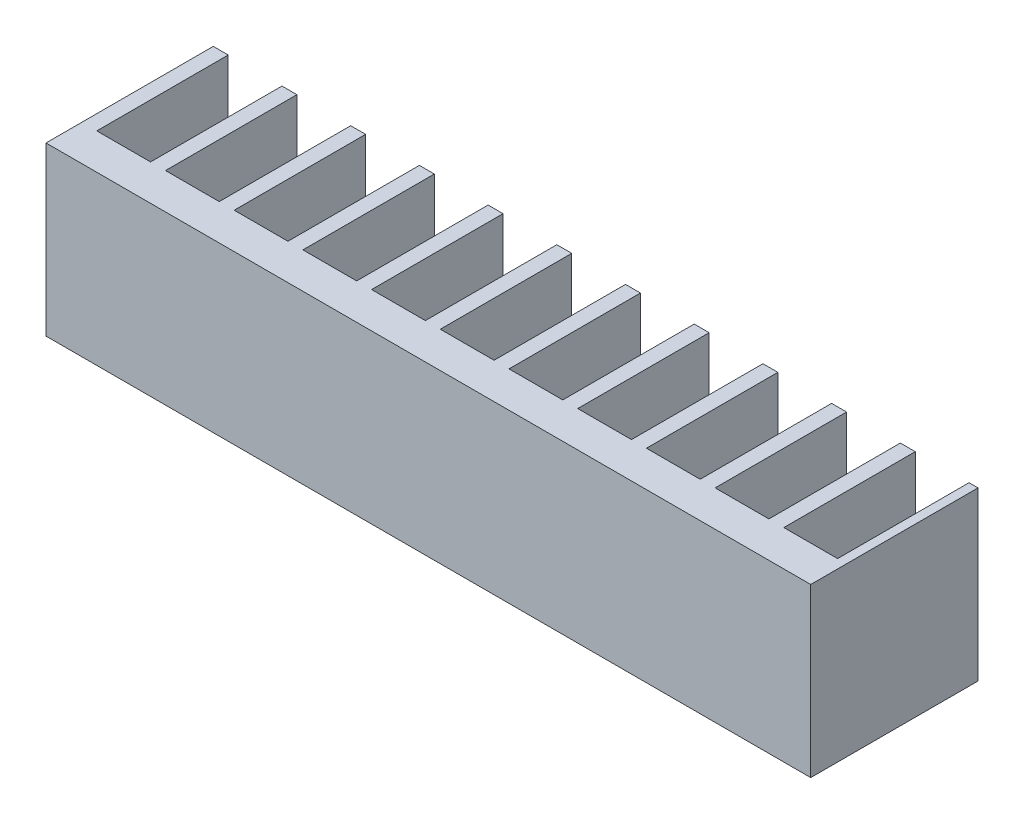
ISO-10303-21;
HEADER;
FILE_DESCRIPTION(('STEP AP214'),'2;1');
FILE_NAME('part.step','',(''),(''),'','','');
FILE_SCHEMA(('AUTOMOTIVE_DESIGN { 1 0 10303 214 1 1 1 1 }'));
ENDSEC;
DATA;
#1=APPLICATION_CONTEXT('core data for automotive mechanical design processes');
#2=APPLICATION_PROTOCOL_DEFINITION('international standard','automotive_design',2000,#1);
#3=PRODUCT_CONTEXT('',#1,'mechanical');
#4=PRODUCT('Part','Part','',(#3));
#5=PRODUCT_RELATED_PRODUCT_CATEGORY('part','',(#4));
#6=PRODUCT_DEFINITION_FORMATION('','',#4);
#7=PRODUCT_DEFINITION_CONTEXT('part definition',#1,'design');
#8=PRODUCT_DEFINITION('design','',#6,#7);
#9=PRODUCT_DEFINITION_SHAPE('','',#8);
#10=(LENGTH_UNIT() NAMED_UNIT(*) SI_UNIT(.MILLI.,.METRE.));
#11=(NAMED_UNIT(*) PLANE_ANGLE_UNIT() SI_UNIT($,.RADIAN.));
#12=(NAMED_UNIT(*) SI_UNIT($,.STERADIAN.) SOLID_ANGLE_UNIT());
#13=UNCERTAINTY_MEASURE_WITH_UNIT(LENGTH_MEASURE(1.E-05),#10,'distance_accuracy_value','');
#14=(GEOMETRIC_REPRESENTATION_CONTEXT(3) GLOBAL_UNCERTAINTY_ASSIGNED_CONTEXT((#13)) GLOBAL_UNIT_ASSIGNED_CONTEXT((#10,
#11,#12)) REPRESENTATION_CONTEXT('',''));
#15=CARTESIAN_POINT('',(0.,0.,0.));
#16=DIRECTION('',(0.,0.,1.));
#17=DIRECTION('',(1.,0.,0.));
#18=AXIS2_PLACEMENT_3D('',#15,#16,#17);
#19=CARTESIAN_POINT('',(32.,14.,-7.));
#20=DIRECTION('',(-1.,0.,0.));
#21=DIRECTION('',(0.,0.,1.));
#22=AXIS2_PLACEMENT_3D('',#19,#20,#21);
#23=PLANE('',#22);
#24=DIRECTION('',(0.,0.,-1.));
#25=VECTOR('',#24,1.);
#26=CARTESIAN_POINT('',(32.,0.,-7.));
#27=LINE('',#26,#25);
#28=CARTESIAN_POINT('',(32.,0.,7.));
#29=VERTEX_POINT('',#28);
#30=CARTESIAN_POINT('',(32.,0.,-7.));
#31=VERTEX_POINT('',#30);
#32=EDGE_CURVE('E380',#29,#31,#27,.T.);
#33=ORIENTED_EDGE('',*,*,#32,.T.);
#34=DIRECTION('',(0.,-1.,0.));
#35=VECTOR('',#34,1.);
#36=CARTESIAN_POINT('',(32.,14.,-7.));
#37=LINE('',#36,#35);
#38=CARTESIAN_POINT('',(32.,14.,-7.));
#39=VERTEX_POINT('',#38);
#40=EDGE_CURVE('E11',#39,#31,#37,.T.);
#41=ORIENTED_EDGE('',*,*,#40,.F.);
#42=DIRECTION('',(0.,0.,-1.));
#43=VECTOR('',#42,1.);
#44=CARTESIAN_POINT('',(32.,14.,-7.));
#45=LINE('',#44,#43);
#46=CARTESIAN_POINT('',(32.,14.,7.));
#47=VERTEX_POINT('',#46);
#48=EDGE_CURVE('E522',#47,#39,#45,.T.);
#49=ORIENTED_EDGE('',*,*,#48,.F.);
#50=DIRECTION('',(0.,-1.,0.));
#51=VECTOR('',#50,1.);
#52=CARTESIAN_POINT('',(32.,14.,7.));
#53=LINE('',#52,#51);
#54=EDGE_CURVE('E376',#47,#29,#53,.T.);
#55=ORIENTED_EDGE('',*,*,#54,.T.);
#56=EDGE_LOOP('',(#33,#41,#49,#55));
#57=FACE_BOUND('',#56,.T.);
#58=ADVANCED_FACE('F39',(#57),#23,.F.);
#59=CARTESIAN_POINT('',(31.25,14.,-7.));
#60=DIRECTION('',(0.,0.,1.));
#61=DIRECTION('',(1.,0.,0.));
#62=AXIS2_PLACEMENT_3D('',#59,#60,#61);
#63=PLANE('',#62);
#64=DIRECTION('',(-1.,0.,0.));
#65=VECTOR('',#64,1.);
#66=CARTESIAN_POINT('',(31.25,0.,-7.));
#67=LINE('',#66,#65);
#68=CARTESIAN_POINT('',(31.25,0.,-7.));
#69=VERTEX_POINT('',#68);
#70=EDGE_CURVE('E384',#31,#69,#67,.T.);
#71=ORIENTED_EDGE('',*,*,#70,.T.);
#72=DIRECTION('',(0.,-1.,0.));
#73=VECTOR('',#72,1.);
#74=CARTESIAN_POINT('',(31.25,14.,-7.));
#75=LINE('',#74,#73);
#76=CARTESIAN_POINT('',(31.25,14.,-7.));
#77=VERTEX_POINT('',#76);
#78=EDGE_CURVE('E48',#77,#69,#75,.T.);
#79=ORIENTED_EDGE('',*,*,#78,.F.);
#80=DIRECTION('',(-1.,0.,0.));
#81=VECTOR('',#80,1.);
#82=CARTESIAN_POINT('',(31.25,14.,-7.));
#83=LINE('',#82,#81);
#84=EDGE_CURVE('E219',#39,#77,#83,.T.);
#85=ORIENTED_EDGE('',*,*,#84,.F.);
#86=ORIENTED_EDGE('',*,*,#40,.T.);
#87=EDGE_LOOP('',(#71,#79,#85,#86));
#88=FACE_BOUND('',#87,.T.);
#89=ADVANCED_FACE('F868',(#88),#63,.F.);
#90=CARTESIAN_POINT('',(31.25,14.,4.));
#91=DIRECTION('',(1.,0.,0.));
#92=DIRECTION('',(0.,0.,-1.));
#93=AXIS2_PLACEMENT_3D('',#90,#91,#92);
#94=PLANE('',#93);
#95=DIRECTION('',(0.,0.,1.));
#96=VECTOR('',#95,1.);
#97=CARTESIAN_POINT('',(31.25,0.,4.));
#98=LINE('',#97,#96);
#99=CARTESIAN_POINT('',(31.25,0.,4.));
#100=VERTEX_POINT('',#99);
#101=EDGE_CURVE('E387',#69,#100,#98,.T.);
#102=ORIENTED_EDGE('',*,*,#101,.T.);
#103=DIRECTION('',(0.,-1.,0.));
#104=VECTOR('',#103,1.);
#105=CARTESIAN_POINT('',(31.25,14.,4.));
#106=LINE('',#105,#104);
#107=CARTESIAN_POINT('',(31.25,14.,4.));
#108=VERTEX_POINT('',#107);
#109=EDGE_CURVE('E693',#108,#100,#106,.T.);
#110=ORIENTED_EDGE('',*,*,#109,.F.);
#111=DIRECTION('',(0.,0.,1.));
#112=VECTOR('',#111,1.);
#113=CARTESIAN_POINT('',(31.25,14.,4.));
#114=LINE('',#113,#112);
#115=EDGE_CURVE('E703',#77,#108,#114,.T.);
#116=ORIENTED_EDGE('',*,*,#115,.F.);
#117=ORIENTED_EDGE('',*,*,#78,.T.);
#118=EDGE_LOOP('',(#102,#110,#116,#117));
#119=FACE_BOUND('',#118,.T.);
#120=ADVANCED_FACE('F701',(#119),#94,.F.);
#121=CARTESIAN_POINT('',(26.75,14.,4.));
#122=DIRECTION('',(0.,0.,1.));
#123=DIRECTION('',(1.,0.,0.));
#124=AXIS2_PLACEMENT_3D('',#121,#122,#123);
#125=PLANE('',#124);
#126=DIRECTION('',(-1.,0.,0.));
#127=VECTOR('',#126,1.);
#128=CARTESIAN_POINT('',(26.75,0.,4.));
#129=LINE('',#128,#127);
#130=CARTESIAN_POINT('',(26.75,0.,4.));
#131=VERTEX_POINT('',#130);
#132=EDGE_CURVE('E390',#100,#131,#129,.T.);
#133=ORIENTED_EDGE('',*,*,#132,.T.);
#134=DIRECTION('',(0.,-1.,0.));
#135=VECTOR('',#134,1.);
#136=CARTESIAN_POINT('',(26.75,14.,4.));
#137=LINE('',#136,#135);
#138=CARTESIAN_POINT('',(26.75,14.,4.));
#139=VERTEX_POINT('',#138);
#140=EDGE_CURVE('E689',#139,#131,#137,.T.);
#141=ORIENTED_EDGE('',*,*,#140,.F.);
#142=DIRECTION('',(-1.,0.,0.));
#143=VECTOR('',#142,1.);
#144=CARTESIAN_POINT('',(26.75,14.,4.));
#145=LINE('',#144,#143);
#146=EDGE_CURVE('E722',#108,#139,#145,.T.);
#147=ORIENTED_EDGE('',*,*,#146,.F.);
#148=ORIENTED_EDGE('',*,*,#109,.T.);
#149=EDGE_LOOP('',(#133,#141,#147,#148));
#150=FACE_BOUND('',#149,.T.);
#151=ADVANCED_FACE('F712',(#150),#125,.F.);
#152=CARTESIAN_POINT('',(26.75,14.,-7.));
#153=DIRECTION('',(-1.,0.,0.));
#154=DIRECTION('',(0.,0.,1.));
#155=AXIS2_PLACEMENT_3D('',#152,#153,#154);
#156=PLANE('',#155);
#157=DIRECTION('',(0.,0.,-1.));
#158=VECTOR('',#157,1.);
#159=CARTESIAN_POINT('',(26.75,0.,-7.));
#160=LINE('',#159,#158);
#161=CARTESIAN_POINT('',(26.75,0.,-7.));
#162=VERTEX_POINT('',#161);
#163=EDGE_CURVE('E393',#131,#162,#160,.T.);
#164=ORIENTED_EDGE('',*,*,#163,.T.);
#165=DIRECTION('',(0.,-1.,0.));
#166=VECTOR('',#165,1.);
#167=CARTESIAN_POINT('',(26.75,14.,-7.));
#168=LINE('',#167,#166);
#169=CARTESIAN_POINT('',(26.75,14.,-7.));
#170=VERTEX_POINT('',#169);
#171=EDGE_CURVE('E685',#170,#162,#168,.T.);
#172=ORIENTED_EDGE('',*,*,#171,.F.);
#173=DIRECTION('',(0.,0.,-1.));
#174=VECTOR('',#173,1.);
#175=CARTESIAN_POINT('',(26.75,14.,-7.));
#176=LINE('',#175,#174);
#177=EDGE_CURVE('E718',#139,#170,#176,.T.);
#178=ORIENTED_EDGE('',*,*,#177,.F.);
#179=ORIENTED_EDGE('',*,*,#140,.T.);
#180=EDGE_LOOP('',(#164,#172,#178,#179));
#181=FACE_BOUND('',#180,.T.);
#182=ADVANCED_FACE('F716',(#181),#156,.F.);
#183=CARTESIAN_POINT('',(25.5,14.,-7.));
#184=DIRECTION('',(0.,0.,1.));
#185=DIRECTION('',(1.,0.,0.));
#186=AXIS2_PLACEMENT_3D('',#183,#184,#185);
#187=PLANE('',#186);
#188=DIRECTION('',(-1.,0.,0.));
#189=VECTOR('',#188,1.);
#190=CARTESIAN_POINT('',(25.5,0.,-7.));
#191=LINE('',#190,#189);
#192=CARTESIAN_POINT('',(25.5,0.,-7.));
#193=VERTEX_POINT('',#192);
#194=EDGE_CURVE('E396',#162,#193,#191,.T.);
#195=ORIENTED_EDGE('',*,*,#194,.T.);
#196=DIRECTION('',(0.,-1.,0.));
#197=VECTOR('',#196,1.);
#198=CARTESIAN_POINT('',(25.5,14.,-7.));
#199=LINE('',#198,#197);
#200=CARTESIAN_POINT('',(25.5,14.,-7.));
#201=VERTEX_POINT('',#200);
#202=EDGE_CURVE('E681',#201,#193,#199,.T.);
#203=ORIENTED_EDGE('',*,*,#202,.F.);
#204=DIRECTION('',(-1.,0.,0.));
#205=VECTOR('',#204,1.);
#206=CARTESIAN_POINT('',(25.5,14.,-7.));
#207=LINE('',#206,#205);
#208=EDGE_CURVE('E721',#170,#201,#207,.T.);
#209=ORIENTED_EDGE('',*,*,#208,.F.);
#210=ORIENTED_EDGE('',*,*,#171,.T.);
#211=EDGE_LOOP('',(#195,#203,#209,#210));
#212=FACE_BOUND('',#211,.T.);
#213=ADVANCED_FACE('F881',(#212),#187,.F.);
#214=CARTESIAN_POINT('',(25.5,14.,4.));
#215=DIRECTION('',(1.,0.,0.));
#216=DIRECTION('',(0.,0.,-1.));
#217=AXIS2_PLACEMENT_3D('',#214,#215,#216);
#218=PLANE('',#217);
#219=DIRECTION('',(0.,0.,1.));
#220=VECTOR('',#219,1.);
#221=CARTESIAN_POINT('',(25.5,0.,4.));
#222=LINE('',#221,#220);
#223=CARTESIAN_POINT('',(25.5,0.,4.));
#224=VERTEX_POINT('',#223);
#225=EDGE_CURVE('E399',#193,#224,#222,.T.);
#226=ORIENTED_EDGE('',*,*,#225,.T.);
#227=DIRECTION('',(0.,-1.,0.));
#228=VECTOR('',#227,1.);
#229=CARTESIAN_POINT('',(25.5,14.,4.));
#230=LINE('',#229,#228);
#231=CARTESIAN_POINT('',(25.5,14.,4.));
#232=VERTEX_POINT('',#231);
#233=EDGE_CURVE('E677',#232,#224,#230,.T.);
#234=ORIENTED_EDGE('',*,*,#233,.F.);
#235=DIRECTION('',(0.,0.,1.));
#236=VECTOR('',#235,1.);
#237=CARTESIAN_POINT('',(25.5,14.,4.));
#238=LINE('',#237,#236);
#239=EDGE_CURVE('E726',#201,#232,#238,.T.);
#240=ORIENTED_EDGE('',*,*,#239,.F.);
#241=ORIENTED_EDGE('',*,*,#202,.T.);
#242=EDGE_LOOP('',(#226,#234,#240,#241));
#243=FACE_BOUND('',#242,.T.);
#244=ADVANCED_FACE('F884',(#243),#218,.F.);
#245=CARTESIAN_POINT('',(21.,14.,4.));
#246=DIRECTION('',(0.,0.,1.));
#247=DIRECTION('',(1.,0.,0.));
#248=AXIS2_PLACEMENT_3D('',#245,#246,#247);
#249=PLANE('',#248);
#250=DIRECTION('',(-1.,0.,0.));
#251=VECTOR('',#250,1.);
#252=CARTESIAN_POINT('',(21.,0.,4.));
#253=LINE('',#252,#251);
#254=CARTESIAN_POINT('',(21.,0.,4.));
#255=VERTEX_POINT('',#254);
#256=EDGE_CURVE('E402',#224,#255,#253,.T.);
#257=ORIENTED_EDGE('',*,*,#256,.T.);
#258=DIRECTION('',(0.,-1.,0.));
#259=VECTOR('',#258,1.);
#260=CARTESIAN_POINT('',(21.,14.,4.));
#261=LINE('',#260,#259);
#262=CARTESIAN_POINT('',(21.,14.,4.));
#263=VERTEX_POINT('',#262);
#264=EDGE_CURVE('E673',#263,#255,#261,.T.);
#265=ORIENTED_EDGE('',*,*,#264,.F.);
#266=DIRECTION('',(-1.,0.,0.));
#267=VECTOR('',#266,1.);
#268=CARTESIAN_POINT('',(21.,14.,4.));
#269=LINE('',#268,#267);
#270=EDGE_CURVE('E733',#232,#263,#269,.T.);
#271=ORIENTED_EDGE('',*,*,#270,.F.);
#272=ORIENTED_EDGE('',*,*,#233,.T.);
#273=EDGE_LOOP('',(#257,#265,#271,#272));
#274=FACE_BOUND('',#273,.T.);
#275=ADVANCED_FACE('F888',(#274),#249,.F.);
#276=CARTESIAN_POINT('',(21.,14.,-7.));
#277=DIRECTION('',(-1.,0.,0.));
#278=DIRECTION('',(0.,0.,1.));
#279=AXIS2_PLACEMENT_3D('',#276,#277,#278);
#280=PLANE('',#279);
#281=DIRECTION('',(0.,0.,-1.));
#282=VECTOR('',#281,1.);
#283=CARTESIAN_POINT('',(21.,0.,-7.));
#284=LINE('',#283,#282);
#285=CARTESIAN_POINT('',(21.,0.,-7.));
#286=VERTEX_POINT('',#285);
#287=EDGE_CURVE('E405',#255,#286,#284,.T.);
#288=ORIENTED_EDGE('',*,*,#287,.T.);
#289=DIRECTION('',(0.,-1.,0.));
#290=VECTOR('',#289,1.);
#291=CARTESIAN_POINT('',(21.,14.,-7.));
#292=LINE('',#291,#290);
#293=CARTESIAN_POINT('',(21.,14.,-7.));
#294=VERTEX_POINT('',#293);
#295=EDGE_CURVE('E669',#294,#286,#292,.T.);
#296=ORIENTED_EDGE('',*,*,#295,.F.);
#297=DIRECTION('',(0.,0.,-1.));
#298=VECTOR('',#297,1.);
#299=CARTESIAN_POINT('',(21.,14.,-7.));
#300=LINE('',#299,#298);
#301=EDGE_CURVE('E736',#263,#294,#300,.T.);
#302=ORIENTED_EDGE('',*,*,#301,.F.);
#303=ORIENTED_EDGE('',*,*,#264,.T.);
#304=EDGE_LOOP('',(#288,#296,#302,#303));
#305=FACE_BOUND('',#304,.T.);
#306=ADVANCED_FACE('F892',(#305),#280,.F.);
#307=CARTESIAN_POINT('',(19.75,14.,-7.));
#308=DIRECTION('',(0.,0.,1.));
#309=DIRECTION('',(1.,0.,0.));
#310=AXIS2_PLACEMENT_3D('',#307,#308,#309);
#311=PLANE('',#310);
#312=DIRECTION('',(-1.,0.,0.));
#313=VECTOR('',#312,1.);
#314=CARTESIAN_POINT('',(19.75,0.,-7.));
#315=LINE('',#314,#313);
#316=CARTESIAN_POINT('',(19.75,0.,-7.));
#317=VERTEX_POINT('',#316);
#318=EDGE_CURVE('E408',#286,#317,#315,.T.);
#319=ORIENTED_EDGE('',*,*,#318,.T.);
#320=DIRECTION('',(0.,-1.,0.));
#321=VECTOR('',#320,1.);
#322=CARTESIAN_POINT('',(19.75,14.,-7.));
#323=LINE('',#322,#321);
#324=CARTESIAN_POINT('',(19.75,14.,-7.));
#325=VERTEX_POINT('',#324);
#326=EDGE_CURVE('E665',#325,#317,#323,.T.);
#327=ORIENTED_EDGE('',*,*,#326,.F.);
#328=DIRECTION('',(-1.,0.,0.));
#329=VECTOR('',#328,1.);
#330=CARTESIAN_POINT('',(19.75,14.,-7.));
#331=LINE('',#330,#329);
#332=EDGE_CURVE('E739',#294,#325,#331,.T.);
#333=ORIENTED_EDGE('',*,*,#332,.F.);
#334=ORIENTED_EDGE('',*,*,#295,.T.);
#335=EDGE_LOOP('',(#319,#327,#333,#334));
#336=FACE_BOUND('',#335,.T.);
#337=ADVANCED_FACE('F896',(#336),#311,.F.);
#338=CARTESIAN_POINT('',(19.75,14.,4.));
#339=DIRECTION('',(1.,0.,0.));
#340=DIRECTION('',(0.,0.,-1.));
#341=AXIS2_PLACEMENT_3D('',#338,#339,#340);
#342=PLANE('',#341);
#343=DIRECTION('',(0.,0.,1.));
#344=VECTOR('',#343,1.);
#345=CARTESIAN_POINT('',(19.75,0.,4.));
#346=LINE('',#345,#344);
#347=CARTESIAN_POINT('',(19.75,0.,4.));
#348=VERTEX_POINT('',#347);
#349=EDGE_CURVE('E411',#317,#348,#346,.T.);
#350=ORIENTED_EDGE('',*,*,#349,.T.);
#351=DIRECTION('',(0.,-1.,0.));
#352=VECTOR('',#351,1.);
#353=CARTESIAN_POINT('',(19.75,14.,4.));
#354=LINE('',#353,#352);
#355=CARTESIAN_POINT('',(19.75,14.,4.));
#356=VERTEX_POINT('',#355);
#357=EDGE_CURVE('E661',#356,#348,#354,.T.);
#358=ORIENTED_EDGE('',*,*,#357,.F.);
#359=DIRECTION('',(0.,0.,1.));
#360=VECTOR('',#359,1.);
#361=CARTESIAN_POINT('',(19.75,14.,4.));
#362=LINE('',#361,#360);
#363=EDGE_CURVE('E742',#325,#356,#362,.T.);
#364=ORIENTED_EDGE('',*,*,#363,.F.);
#365=ORIENTED_EDGE('',*,*,#326,.T.);
#366=EDGE_LOOP('',(#350,#358,#364,#365));
#367=FACE_BOUND('',#366,.T.);
#368=ADVANCED_FACE('F900',(#367),#342,.F.);
#369=CARTESIAN_POINT('',(15.25,14.,4.));
#370=DIRECTION('',(0.,0.,1.));
#371=DIRECTION('',(1.,0.,0.));
#372=AXIS2_PLACEMENT_3D('',#369,#370,#371);
#373=PLANE('',#372);
#374=DIRECTION('',(-1.,0.,0.));
#375=VECTOR('',#374,1.);
#376=CARTESIAN_POINT('',(15.25,0.,4.));
#377=LINE('',#376,#375);
#378=CARTESIAN_POINT('',(15.25,0.,4.));
#379=VERTEX_POINT('',#378);
#380=EDGE_CURVE('E414',#348,#379,#377,.T.);
#381=ORIENTED_EDGE('',*,*,#380,.T.);
#382=DIRECTION('',(0.,-1.,0.));
#383=VECTOR('',#382,1.);
#384=CARTESIAN_POINT('',(15.25,14.,4.));
#385=LINE('',#384,#383);
#386=CARTESIAN_POINT('',(15.25,14.,4.));
#387=VERTEX_POINT('',#386);
#388=EDGE_CURVE('E657',#387,#379,#385,.T.);
#389=ORIENTED_EDGE('',*,*,#388,.F.);
#390=DIRECTION('',(-1.,0.,0.));
#391=VECTOR('',#390,1.);
#392=CARTESIAN_POINT('',(15.25,14.,4.));
#393=LINE('',#392,#391);
#394=EDGE_CURVE('E745',#356,#387,#393,.T.);
#395=ORIENTED_EDGE('',*,*,#394,.F.);
#396=ORIENTED_EDGE('',*,*,#357,.T.);
#397=EDGE_LOOP('',(#381,#389,#395,#396));
#398=FACE_BOUND('',#397,.T.);
#399=ADVANCED_FACE('F904',(#398),#373,.F.);
#400=CARTESIAN_POINT('',(15.25,14.,-7.));
#401=DIRECTION('',(-1.,0.,0.));
#402=DIRECTION('',(0.,0.,1.));
#403=AXIS2_PLACEMENT_3D('',#400,#401,#402);
#404=PLANE('',#403);
#405=DIRECTION('',(0.,0.,-1.));
#406=VECTOR('',#405,1.);
#407=CARTESIAN_POINT('',(15.25,0.,-7.));
#408=LINE('',#407,#406);
#409=CARTESIAN_POINT('',(15.25,0.,-7.));
#410=VERTEX_POINT('',#409);
#411=EDGE_CURVE('E417',#379,#410,#408,.T.);
#412=ORIENTED_EDGE('',*,*,#411,.T.);
#413=DIRECTION('',(0.,-1.,0.));
#414=VECTOR('',#413,1.);
#415=CARTESIAN_POINT('',(15.25,14.,-7.));
#416=LINE('',#415,#414);
#417=CARTESIAN_POINT('',(15.25,14.,-7.));
#418=VERTEX_POINT('',#417);
#419=EDGE_CURVE('E653',#418,#410,#416,.T.);
#420=ORIENTED_EDGE('',*,*,#419,.F.);
#421=DIRECTION('',(0.,0.,-1.));
#422=VECTOR('',#421,1.);
#423=CARTESIAN_POINT('',(15.25,14.,-7.));
#424=LINE('',#423,#422);
#425=EDGE_CURVE('E748',#387,#418,#424,.T.);
#426=ORIENTED_EDGE('',*,*,#425,.F.);
#427=ORIENTED_EDGE('',*,*,#388,.T.);
#428=EDGE_LOOP('',(#412,#420,#426,#427));
#429=FACE_BOUND('',#428,.T.);
#430=ADVANCED_FACE('F908',(#429),#404,.F.);
#431=CARTESIAN_POINT('',(14.,14.,-7.));
#432=DIRECTION('',(0.,0.,1.));
#433=DIRECTION('',(1.,0.,0.));
#434=AXIS2_PLACEMENT_3D('',#431,#432,#433);
#435=PLANE('',#434);
#436=DIRECTION('',(-1.,0.,0.));
#437=VECTOR('',#436,1.);
#438=CARTESIAN_POINT('',(14.,0.,-7.));
#439=LINE('',#438,#437);
#440=CARTESIAN_POINT('',(14.,0.,-7.));
#441=VERTEX_POINT('',#440);
#442=EDGE_CURVE('E420',#410,#441,#439,.T.);
#443=ORIENTED_EDGE('',*,*,#442,.T.);
#444=DIRECTION('',(0.,-1.,0.));
#445=VECTOR('',#444,1.);
#446=CARTESIAN_POINT('',(14.,14.,-7.));
#447=LINE('',#446,#445);
#448=CARTESIAN_POINT('',(14.,14.,-7.));
#449=VERTEX_POINT('',#448);
#450=EDGE_CURVE('E649',#449,#441,#447,.T.);
#451=ORIENTED_EDGE('',*,*,#450,.F.);
#452=DIRECTION('',(-1.,0.,0.));
#453=VECTOR('',#452,1.);
#454=CARTESIAN_POINT('',(14.,14.,-7.));
#455=LINE('',#454,#453);
#456=EDGE_CURVE('E751',#418,#449,#455,.T.);
#457=ORIENTED_EDGE('',*,*,#456,.F.);
#458=ORIENTED_EDGE('',*,*,#419,.T.);
#459=EDGE_LOOP('',(#443,#451,#457,#458));
#460=FACE_BOUND('',#459,.T.);
#461=ADVANCED_FACE('F912',(#460),#435,.F.);
#462=CARTESIAN_POINT('',(14.,14.,4.));
#463=DIRECTION('',(1.,0.,0.));
#464=DIRECTION('',(0.,0.,-1.));
#465=AXIS2_PLACEMENT_3D('',#462,#463,#464);
#466=PLANE('',#465);
#467=DIRECTION('',(0.,0.,1.));
#468=VECTOR('',#467,1.);
#469=CARTESIAN_POINT('',(14.,0.,4.));
#470=LINE('',#469,#468);
#471=CARTESIAN_POINT('',(14.,0.,4.));
#472=VERTEX_POINT('',#471);
#473=EDGE_CURVE('E423',#441,#472,#470,.T.);
#474=ORIENTED_EDGE('',*,*,#473,.T.);
#475=DIRECTION('',(0.,-1.,0.));
#476=VECTOR('',#475,1.);
#477=CARTESIAN_POINT('',(14.,14.,4.));
#478=LINE('',#477,#476);
#479=CARTESIAN_POINT('',(14.,14.,4.));
#480=VERTEX_POINT('',#479);
#481=EDGE_CURVE('E645',#480,#472,#478,.T.);
#482=ORIENTED_EDGE('',*,*,#481,.F.);
#483=DIRECTION('',(0.,0.,1.));
#484=VECTOR('',#483,1.);
#485=CARTESIAN_POINT('',(14.,14.,4.));
#486=LINE('',#485,#484);
#487=EDGE_CURVE('E754',#449,#480,#486,.T.);
#488=ORIENTED_EDGE('',*,*,#487,.F.);
#489=ORIENTED_EDGE('',*,*,#450,.T.);
#490=EDGE_LOOP('',(#474,#482,#488,#489));
#491=FACE_BOUND('',#490,.T.);
#492=ADVANCED_FACE('F916',(#491),#466,.F.);
#493=CARTESIAN_POINT('',(9.49999999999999,14.,4.));
#494=DIRECTION('',(0.,0.,1.));
#495=DIRECTION('',(1.,0.,0.));
#496=AXIS2_PLACEMENT_3D('',#493,#494,#495);
#497=PLANE('',#496);
#498=DIRECTION('',(-1.,0.,0.));
#499=VECTOR('',#498,1.);
#500=CARTESIAN_POINT('',(9.49999999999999,0.,4.));
#501=LINE('',#500,#499);
#502=CARTESIAN_POINT('',(9.49999999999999,0.,4.));
#503=VERTEX_POINT('',#502);
#504=EDGE_CURVE('E426',#472,#503,#501,.T.);
#505=ORIENTED_EDGE('',*,*,#504,.T.);
#506=DIRECTION('',(0.,-1.,0.));
#507=VECTOR('',#506,1.);
#508=CARTESIAN_POINT('',(9.49999999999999,14.,4.));
#509=LINE('',#508,#507);
#510=CARTESIAN_POINT('',(9.49999999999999,14.,4.));
#511=VERTEX_POINT('',#510);
#512=EDGE_CURVE('E641',#511,#503,#509,.T.);
#513=ORIENTED_EDGE('',*,*,#512,.F.);
#514=DIRECTION('',(-1.,0.,0.));
#515=VECTOR('',#514,1.);
#516=CARTESIAN_POINT('',(9.49999999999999,14.,4.));
#517=LINE('',#516,#515);
#518=EDGE_CURVE('E757',#480,#511,#517,.T.);
#519=ORIENTED_EDGE('',*,*,#518,.F.);
#520=ORIENTED_EDGE('',*,*,#481,.T.);
#521=EDGE_LOOP('',(#505,#513,#519,#520));
#522=FACE_BOUND('',#521,.T.);
#523=ADVANCED_FACE('F920',(#522),#497,.F.);
#524=CARTESIAN_POINT('',(9.49999999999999,14.,-7.));
#525=DIRECTION('',(-1.,0.,0.));
#526=DIRECTION('',(0.,0.,1.));
#527=AXIS2_PLACEMENT_3D('',#524,#525,#526);
#528=PLANE('',#527);
#529=DIRECTION('',(0.,0.,-1.));
#530=VECTOR('',#529,1.);
#531=CARTESIAN_POINT('',(9.49999999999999,0.,-7.));
#532=LINE('',#531,#530);
#533=CARTESIAN_POINT('',(9.49999999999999,0.,-7.));
#534=VERTEX_POINT('',#533);
#535=EDGE_CURVE('E429',#503,#534,#532,.T.);
#536=ORIENTED_EDGE('',*,*,#535,.T.);
#537=DIRECTION('',(0.,-1.,0.));
#538=VECTOR('',#537,1.);
#539=CARTESIAN_POINT('',(9.49999999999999,14.,-7.));
#540=LINE('',#539,#538);
#541=CARTESIAN_POINT('',(9.49999999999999,14.,-7.));
#542=VERTEX_POINT('',#541);
#543=EDGE_CURVE('E637',#542,#534,#540,.T.);
#544=ORIENTED_EDGE('',*,*,#543,.F.);
#545=DIRECTION('',(0.,0.,-1.));
#546=VECTOR('',#545,1.);
#547=CARTESIAN_POINT('',(9.49999999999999,14.,-7.));
#548=LINE('',#547,#546);
#549=EDGE_CURVE('E760',#511,#542,#548,.T.);
#550=ORIENTED_EDGE('',*,*,#549,.F.);
#551=ORIENTED_EDGE('',*,*,#512,.T.);
#552=EDGE_LOOP('',(#536,#544,#550,#551));
#553=FACE_BOUND('',#552,.T.);
#554=ADVANCED_FACE('F924',(#553),#528,.F.);
#555=CARTESIAN_POINT('',(8.25,14.,-7.));
#556=DIRECTION('',(0.,0.,1.));
#557=DIRECTION('',(1.,0.,0.));
#558=AXIS2_PLACEMENT_3D('',#555,#556,#557);
#559=PLANE('',#558);
#560=DIRECTION('',(-1.,0.,0.));
#561=VECTOR('',#560,1.);
#562=CARTESIAN_POINT('',(8.25,0.,-7.));
#563=LINE('',#562,#561);
#564=CARTESIAN_POINT('',(8.25,0.,-7.));
#565=VERTEX_POINT('',#564);
#566=EDGE_CURVE('E432',#534,#565,#563,.T.);
#567=ORIENTED_EDGE('',*,*,#566,.T.);
#568=DIRECTION('',(0.,-1.,0.));
#569=VECTOR('',#568,1.);
#570=CARTESIAN_POINT('',(8.25,14.,-7.));
#571=LINE('',#570,#569);
#572=CARTESIAN_POINT('',(8.25,14.,-7.));
#573=VERTEX_POINT('',#572);
#574=EDGE_CURVE('E633',#573,#565,#571,.T.);
#575=ORIENTED_EDGE('',*,*,#574,.F.);
#576=DIRECTION('',(-1.,0.,0.));
#577=VECTOR('',#576,1.);
#578=CARTESIAN_POINT('',(8.25,14.,-7.));
#579=LINE('',#578,#577);
#580=EDGE_CURVE('E763',#542,#573,#579,.T.);
#581=ORIENTED_EDGE('',*,*,#580,.F.);
#582=ORIENTED_EDGE('',*,*,#543,.T.);
#583=EDGE_LOOP('',(#567,#575,#581,#582));
#584=FACE_BOUND('',#583,.T.);
#585=ADVANCED_FACE('F928',(#584),#559,.F.);
#586=CARTESIAN_POINT('',(8.25,14.,4.));
#587=DIRECTION('',(1.,0.,0.));
#588=DIRECTION('',(0.,0.,-1.));
#589=AXIS2_PLACEMENT_3D('',#586,#587,#588);
#590=PLANE('',#589);
#591=DIRECTION('',(0.,0.,1.));
#592=VECTOR('',#591,1.);
#593=CARTESIAN_POINT('',(8.25,0.,4.));
#594=LINE('',#593,#592);
#595=CARTESIAN_POINT('',(8.25,0.,4.));
#596=VERTEX_POINT('',#595);
#597=EDGE_CURVE('E435',#565,#596,#594,.T.);
#598=ORIENTED_EDGE('',*,*,#597,.T.);
#599=DIRECTION('',(0.,-1.,0.));
#600=VECTOR('',#599,1.);
#601=CARTESIAN_POINT('',(8.25,14.,4.));
#602=LINE('',#601,#600);
#603=CARTESIAN_POINT('',(8.25,14.,4.));
#604=VERTEX_POINT('',#603);
#605=EDGE_CURVE('E629',#604,#596,#602,.T.);
#606=ORIENTED_EDGE('',*,*,#605,.F.);
#607=DIRECTION('',(0.,0.,1.));
#608=VECTOR('',#607,1.);
#609=CARTESIAN_POINT('',(8.25,14.,4.));
#610=LINE('',#609,#608);
#611=EDGE_CURVE('E766',#573,#604,#610,.T.);
#612=ORIENTED_EDGE('',*,*,#611,.F.);
#613=ORIENTED_EDGE('',*,*,#574,.T.);
#614=EDGE_LOOP('',(#598,#606,#612,#613));
#615=FACE_BOUND('',#614,.T.);
#616=ADVANCED_FACE('F932',(#615),#590,.F.);
#617=CARTESIAN_POINT('',(3.75,14.,4.));
#618=DIRECTION('',(0.,0.,1.));
#619=DIRECTION('',(1.,0.,0.));
#620=AXIS2_PLACEMENT_3D('',#617,#618,#619);
#621=PLANE('',#620);
#622=DIRECTION('',(-1.,0.,0.));
#623=VECTOR('',#622,1.);
#624=CARTESIAN_POINT('',(3.75,0.,4.));
#625=LINE('',#624,#623);
#626=CARTESIAN_POINT('',(3.75,0.,4.));
#627=VERTEX_POINT('',#626);
#628=EDGE_CURVE('E438',#596,#627,#625,.T.);
#629=ORIENTED_EDGE('',*,*,#628,.T.);
#630=DIRECTION('',(0.,-1.,0.));
#631=VECTOR('',#630,1.);
#632=CARTESIAN_POINT('',(3.75,14.,4.));
#633=LINE('',#632,#631);
#634=CARTESIAN_POINT('',(3.75,14.,4.));
#635=VERTEX_POINT('',#634);
#636=EDGE_CURVE('E625',#635,#627,#633,.T.);
#637=ORIENTED_EDGE('',*,*,#636,.F.);
#638=DIRECTION('',(-1.,0.,0.));
#639=VECTOR('',#638,1.);
#640=CARTESIAN_POINT('',(3.75,14.,4.));
#641=LINE('',#640,#639);
#642=EDGE_CURVE('E769',#604,#635,#641,.T.);
#643=ORIENTED_EDGE('',*,*,#642,.F.);
#644=ORIENTED_EDGE('',*,*,#605,.T.);
#645=EDGE_LOOP('',(#629,#637,#643,#644));
#646=FACE_BOUND('',#645,.T.);
#647=ADVANCED_FACE('F936',(#646),#621,.F.);
#648=CARTESIAN_POINT('',(3.75,14.,-7.));
#649=DIRECTION('',(-1.,0.,0.));
#650=DIRECTION('',(0.,0.,1.));
#651=AXIS2_PLACEMENT_3D('',#648,#649,#650);
#652=PLANE('',#651);
#653=DIRECTION('',(0.,0.,-1.));
#654=VECTOR('',#653,1.);
#655=CARTESIAN_POINT('',(3.75,0.,-7.));
#656=LINE('',#655,#654);
#657=CARTESIAN_POINT('',(3.75,0.,-7.));
#658=VERTEX_POINT('',#657);
#659=EDGE_CURVE('E441',#627,#658,#656,.T.);
#660=ORIENTED_EDGE('',*,*,#659,.T.);
#661=DIRECTION('',(0.,-1.,0.));
#662=VECTOR('',#661,1.);
#663=CARTESIAN_POINT('',(3.75,14.,-7.));
#664=LINE('',#663,#662);
#665=CARTESIAN_POINT('',(3.75,14.,-7.));
#666=VERTEX_POINT('',#665);
#667=EDGE_CURVE('E621',#666,#658,#664,.T.);
#668=ORIENTED_EDGE('',*,*,#667,.F.);
#669=DIRECTION('',(0.,0.,-1.));
#670=VECTOR('',#669,1.);
#671=CARTESIAN_POINT('',(3.75,14.,-7.));
#672=LINE('',#671,#670);
#673=EDGE_CURVE('E772',#635,#666,#672,.T.);
#674=ORIENTED_EDGE('',*,*,#673,.F.);
#675=ORIENTED_EDGE('',*,*,#636,.T.);
#676=EDGE_LOOP('',(#660,#668,#674,#675));
#677=FACE_BOUND('',#676,.T.);
#678=ADVANCED_FACE('F940',(#677),#652,.F.);
#679=CARTESIAN_POINT('',(2.49999999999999,14.,-7.));
#680=DIRECTION('',(0.,0.,1.));
#681=DIRECTION('',(1.,0.,0.));
#682=AXIS2_PLACEMENT_3D('',#679,#680,#681);
#683=PLANE('',#682);
#684=DIRECTION('',(-1.,0.,0.));
#685=VECTOR('',#684,1.);
#686=CARTESIAN_POINT('',(2.49999999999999,0.,-7.));
#687=LINE('',#686,#685);
#688=CARTESIAN_POINT('',(2.49999999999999,0.,-7.));
#689=VERTEX_POINT('',#688);
#690=EDGE_CURVE('E444',#658,#689,#687,.T.);
#691=ORIENTED_EDGE('',*,*,#690,.T.);
#692=DIRECTION('',(0.,-1.,0.));
#693=VECTOR('',#692,1.);
#694=CARTESIAN_POINT('',(2.49999999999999,14.,-7.));
#695=LINE('',#694,#693);
#696=CARTESIAN_POINT('',(2.49999999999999,14.,-7.));
#697=VERTEX_POINT('',#696);
#698=EDGE_CURVE('E617',#697,#689,#695,.T.);
#699=ORIENTED_EDGE('',*,*,#698,.F.);
#700=DIRECTION('',(-1.,0.,0.));
#701=VECTOR('',#700,1.);
#702=CARTESIAN_POINT('',(2.49999999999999,14.,-7.));
#703=LINE('',#702,#701);
#704=EDGE_CURVE('E775',#666,#697,#703,.T.);
#705=ORIENTED_EDGE('',*,*,#704,.F.);
#706=ORIENTED_EDGE('',*,*,#667,.T.);
#707=EDGE_LOOP('',(#691,#699,#705,#706));
#708=FACE_BOUND('',#707,.T.);
#709=ADVANCED_FACE('F944',(#708),#683,.F.);
#710=CARTESIAN_POINT('',(2.49999999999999,14.,4.));
#711=DIRECTION('',(1.,0.,0.));
#712=DIRECTION('',(0.,0.,-1.));
#713=AXIS2_PLACEMENT_3D('',#710,#711,#712);
#714=PLANE('',#713);
#715=DIRECTION('',(0.,0.,1.));
#716=VECTOR('',#715,1.);
#717=CARTESIAN_POINT('',(2.49999999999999,0.,4.));
#718=LINE('',#717,#716);
#719=CARTESIAN_POINT('',(2.49999999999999,0.,4.));
#720=VERTEX_POINT('',#719);
#721=EDGE_CURVE('E447',#689,#720,#718,.T.);
#722=ORIENTED_EDGE('',*,*,#721,.T.);
#723=DIRECTION('',(0.,-1.,0.));
#724=VECTOR('',#723,1.);
#725=CARTESIAN_POINT('',(2.49999999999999,14.,4.));
#726=LINE('',#725,#724);
#727=CARTESIAN_POINT('',(2.49999999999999,14.,4.));
#728=VERTEX_POINT('',#727);
#729=EDGE_CURVE('E613',#728,#720,#726,.T.);
#730=ORIENTED_EDGE('',*,*,#729,.F.);
#731=DIRECTION('',(0.,0.,1.));
#732=VECTOR('',#731,1.);
#733=CARTESIAN_POINT('',(2.49999999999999,14.,4.));
#734=LINE('',#733,#732);
#735=EDGE_CURVE('E778',#697,#728,#734,.T.);
#736=ORIENTED_EDGE('',*,*,#735,.F.);
#737=ORIENTED_EDGE('',*,*,#698,.T.);
#738=EDGE_LOOP('',(#722,#730,#736,#737));
#739=FACE_BOUND('',#738,.T.);
#740=ADVANCED_FACE('F948',(#739),#714,.F.);
#741=CARTESIAN_POINT('',(-2.00000000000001,14.,4.));
#742=DIRECTION('',(0.,0.,1.));
#743=DIRECTION('',(1.,0.,0.));
#744=AXIS2_PLACEMENT_3D('',#741,#742,#743);
#745=PLANE('',#744);
#746=DIRECTION('',(-1.,0.,0.));
#747=VECTOR('',#746,1.);
#748=CARTESIAN_POINT('',(-2.00000000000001,0.,4.));
#749=LINE('',#748,#747);
#750=CARTESIAN_POINT('',(-2.00000000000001,0.,4.));
#751=VERTEX_POINT('',#750);
#752=EDGE_CURVE('E450',#720,#751,#749,.T.);
#753=ORIENTED_EDGE('',*,*,#752,.T.);
#754=DIRECTION('',(0.,-1.,0.));
#755=VECTOR('',#754,1.);
#756=CARTESIAN_POINT('',(-2.00000000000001,14.,4.));
#757=LINE('',#756,#755);
#758=CARTESIAN_POINT('',(-2.00000000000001,14.,4.));
#759=VERTEX_POINT('',#758);
#760=EDGE_CURVE('E609',#759,#751,#757,.T.);
#761=ORIENTED_EDGE('',*,*,#760,.F.);
#762=DIRECTION('',(-1.,0.,0.));
#763=VECTOR('',#762,1.);
#764=CARTESIAN_POINT('',(-2.00000000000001,14.,4.));
#765=LINE('',#764,#763);
#766=EDGE_CURVE('E781',#728,#759,#765,.T.);
#767=ORIENTED_EDGE('',*,*,#766,.F.);
#768=ORIENTED_EDGE('',*,*,#729,.T.);
#769=EDGE_LOOP('',(#753,#761,#767,#768));
#770=FACE_BOUND('',#769,.T.);
#771=ADVANCED_FACE('F952',(#770),#745,.F.);
#772=CARTESIAN_POINT('',(-2.00000000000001,14.,-7.));
#773=DIRECTION('',(-1.,0.,0.));
#774=DIRECTION('',(0.,0.,1.));
#775=AXIS2_PLACEMENT_3D('',#772,#773,#774);
#776=PLANE('',#775);
#777=DIRECTION('',(0.,0.,-1.));
#778=VECTOR('',#777,1.);
#779=CARTESIAN_POINT('',(-2.00000000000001,0.,-7.));
#780=LINE('',#779,#778);
#781=CARTESIAN_POINT('',(-2.00000000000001,0.,-7.));
#782=VERTEX_POINT('',#781);
#783=EDGE_CURVE('E453',#751,#782,#780,.T.);
#784=ORIENTED_EDGE('',*,*,#783,.T.);
#785=DIRECTION('',(0.,-1.,0.));
#786=VECTOR('',#785,1.);
#787=CARTESIAN_POINT('',(-2.00000000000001,14.,-7.));
#788=LINE('',#787,#786);
#789=CARTESIAN_POINT('',(-2.00000000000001,14.,-7.));
#790=VERTEX_POINT('',#789);
#791=EDGE_CURVE('E605',#790,#782,#788,.T.);
#792=ORIENTED_EDGE('',*,*,#791,.F.);
#793=DIRECTION('',(0.,0.,-1.));
#794=VECTOR('',#793,1.);
#795=CARTESIAN_POINT('',(-2.00000000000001,14.,-7.));
#796=LINE('',#795,#794);
#797=EDGE_CURVE('E784',#759,#790,#796,.T.);
#798=ORIENTED_EDGE('',*,*,#797,.F.);
#799=ORIENTED_EDGE('',*,*,#760,.T.);
#800=EDGE_LOOP('',(#784,#792,#798,#799));
#801=FACE_BOUND('',#800,.T.);
#802=ADVANCED_FACE('F956',(#801),#776,.F.);
#803=CARTESIAN_POINT('',(-3.25000000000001,14.,-7.));
#804=DIRECTION('',(0.,0.,1.));
#805=DIRECTION('',(1.,0.,0.));
#806=AXIS2_PLACEMENT_3D('',#803,#804,#805);
#807=PLANE('',#806);
#808=DIRECTION('',(-1.,0.,0.));
#809=VECTOR('',#808,1.);
#810=CARTESIAN_POINT('',(-3.25000000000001,0.,-7.));
#811=LINE('',#810,#809);
#812=CARTESIAN_POINT('',(-3.25000000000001,0.,-7.));
#813=VERTEX_POINT('',#812);
#814=EDGE_CURVE('E456',#782,#813,#811,.T.);
#815=ORIENTED_EDGE('',*,*,#814,.T.);
#816=DIRECTION('',(0.,-1.,0.));
#817=VECTOR('',#816,1.);
#818=CARTESIAN_POINT('',(-3.25000000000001,14.,-7.));
#819=LINE('',#818,#817);
#820=CARTESIAN_POINT('',(-3.25000000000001,14.,-7.));
#821=VERTEX_POINT('',#820);
#822=EDGE_CURVE('E601',#821,#813,#819,.T.);
#823=ORIENTED_EDGE('',*,*,#822,.F.);
#824=DIRECTION('',(-1.,0.,0.));
#825=VECTOR('',#824,1.);
#826=CARTESIAN_POINT('',(-3.25000000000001,14.,-7.));
#827=LINE('',#826,#825);
#828=EDGE_CURVE('E787',#790,#821,#827,.T.);
#829=ORIENTED_EDGE('',*,*,#828,.F.);
#830=ORIENTED_EDGE('',*,*,#791,.T.);
#831=EDGE_LOOP('',(#815,#823,#829,#830));
#832=FACE_BOUND('',#831,.T.);
#833=ADVANCED_FACE('F960',(#832),#807,.F.);
#834=CARTESIAN_POINT('',(-3.25000000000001,14.,4.));
#835=DIRECTION('',(1.,0.,0.));
#836=DIRECTION('',(0.,0.,-1.));
#837=AXIS2_PLACEMENT_3D('',#834,#835,#836);
#838=PLANE('',#837);
#839=DIRECTION('',(0.,0.,1.));
#840=VECTOR('',#839,1.);
#841=CARTESIAN_POINT('',(-3.25000000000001,0.,4.));
#842=LINE('',#841,#840);
#843=CARTESIAN_POINT('',(-3.25000000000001,0.,4.));
#844=VERTEX_POINT('',#843);
#845=EDGE_CURVE('E459',#813,#844,#842,.T.);
#846=ORIENTED_EDGE('',*,*,#845,.T.);
#847=DIRECTION('',(0.,-1.,0.));
#848=VECTOR('',#847,1.);
#849=CARTESIAN_POINT('',(-3.25000000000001,14.,4.));
#850=LINE('',#849,#848);
#851=CARTESIAN_POINT('',(-3.25000000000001,14.,4.));
#852=VERTEX_POINT('',#851);
#853=EDGE_CURVE('E597',#852,#844,#850,.T.);
#854=ORIENTED_EDGE('',*,*,#853,.F.);
#855=DIRECTION('',(0.,0.,1.));
#856=VECTOR('',#855,1.);
#857=CARTESIAN_POINT('',(-3.25000000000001,14.,4.));
#858=LINE('',#857,#856);
#859=EDGE_CURVE('E790',#821,#852,#858,.T.);
#860=ORIENTED_EDGE('',*,*,#859,.F.);
#861=ORIENTED_EDGE('',*,*,#822,.T.);
#862=EDGE_LOOP('',(#846,#854,#860,#861));
#863=FACE_BOUND('',#862,.T.);
#864=ADVANCED_FACE('F964',(#863),#838,.F.);
#865=CARTESIAN_POINT('',(-7.75000000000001,14.,4.));
#866=DIRECTION('',(0.,0.,1.));
#867=DIRECTION('',(1.,0.,0.));
#868=AXIS2_PLACEMENT_3D('',#865,#866,#867);
#869=PLANE('',#868);
#870=DIRECTION('',(-1.,0.,0.));
#871=VECTOR('',#870,1.);
#872=CARTESIAN_POINT('',(-7.75000000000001,0.,4.));
#873=LINE('',#872,#871);
#874=CARTESIAN_POINT('',(-7.75000000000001,0.,4.));
#875=VERTEX_POINT('',#874);
#876=EDGE_CURVE('E462',#844,#875,#873,.T.);
#877=ORIENTED_EDGE('',*,*,#876,.T.);
#878=DIRECTION('',(0.,-1.,0.));
#879=VECTOR('',#878,1.);
#880=CARTESIAN_POINT('',(-7.75000000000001,14.,4.));
#881=LINE('',#880,#879);
#882=CARTESIAN_POINT('',(-7.75000000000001,14.,4.));
#883=VERTEX_POINT('',#882);
#884=EDGE_CURVE('E593',#883,#875,#881,.T.);
#885=ORIENTED_EDGE('',*,*,#884,.F.);
#886=DIRECTION('',(-1.,0.,0.));
#887=VECTOR('',#886,1.);
#888=CARTESIAN_POINT('',(-7.75000000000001,14.,4.));
#889=LINE('',#888,#887);
#890=EDGE_CURVE('E793',#852,#883,#889,.T.);
#891=ORIENTED_EDGE('',*,*,#890,.F.);
#892=ORIENTED_EDGE('',*,*,#853,.T.);
#893=EDGE_LOOP('',(#877,#885,#891,#892));
#894=FACE_BOUND('',#893,.T.);
#895=ADVANCED_FACE('F968',(#894),#869,.F.);
#896=CARTESIAN_POINT('',(-7.75000000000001,14.,-7.));
#897=DIRECTION('',(-1.,0.,0.));
#898=DIRECTION('',(0.,0.,1.));
#899=AXIS2_PLACEMENT_3D('',#896,#897,#898);
#900=PLANE('',#899);
#901=DIRECTION('',(0.,0.,-1.));
#902=VECTOR('',#901,1.);
#903=CARTESIAN_POINT('',(-7.75000000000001,0.,-7.));
#904=LINE('',#903,#902);
#905=CARTESIAN_POINT('',(-7.75000000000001,0.,-7.));
#906=VERTEX_POINT('',#905);
#907=EDGE_CURVE('E465',#875,#906,#904,.T.);
#908=ORIENTED_EDGE('',*,*,#907,.T.);
#909=DIRECTION('',(0.,-1.,0.));
#910=VECTOR('',#909,1.);
#911=CARTESIAN_POINT('',(-7.75000000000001,14.,-7.));
#912=LINE('',#911,#910);
#913=CARTESIAN_POINT('',(-7.75000000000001,14.,-7.));
#914=VERTEX_POINT('',#913);
#915=EDGE_CURVE('E589',#914,#906,#912,.T.);
#916=ORIENTED_EDGE('',*,*,#915,.F.);
#917=DIRECTION('',(0.,0.,-1.));
#918=VECTOR('',#917,1.);
#919=CARTESIAN_POINT('',(-7.75000000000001,14.,-7.));
#920=LINE('',#919,#918);
#921=EDGE_CURVE('E796',#883,#914,#920,.T.);
#922=ORIENTED_EDGE('',*,*,#921,.F.);
#923=ORIENTED_EDGE('',*,*,#884,.T.);
#924=EDGE_LOOP('',(#908,#916,#922,#923));
#925=FACE_BOUND('',#924,.T.);
#926=ADVANCED_FACE('F972',(#925),#900,.F.);
#927=CARTESIAN_POINT('',(-9.00000000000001,14.,-7.));
#928=DIRECTION('',(0.,0.,1.));
#929=DIRECTION('',(1.,0.,0.));
#930=AXIS2_PLACEMENT_3D('',#927,#928,#929);
#931=PLANE('',#930);
#932=DIRECTION('',(-1.,0.,0.));
#933=VECTOR('',#932,1.);
#934=CARTESIAN_POINT('',(-9.00000000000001,0.,-7.));
#935=LINE('',#934,#933);
#936=CARTESIAN_POINT('',(-9.00000000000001,0.,-7.));
#937=VERTEX_POINT('',#936);
#938=EDGE_CURVE('E468',#906,#937,#935,.T.);
#939=ORIENTED_EDGE('',*,*,#938,.T.);
#940=DIRECTION('',(0.,-1.,0.));
#941=VECTOR('',#940,1.);
#942=CARTESIAN_POINT('',(-9.00000000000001,14.,-7.));
#943=LINE('',#942,#941);
#944=CARTESIAN_POINT('',(-9.00000000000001,14.,-7.));
#945=VERTEX_POINT('',#944);
#946=EDGE_CURVE('E585',#945,#937,#943,.T.);
#947=ORIENTED_EDGE('',*,*,#946,.F.);
#948=DIRECTION('',(-1.,0.,0.));
#949=VECTOR('',#948,1.);
#950=CARTESIAN_POINT('',(-9.00000000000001,14.,-7.));
#951=LINE('',#950,#949);
#952=EDGE_CURVE('E799',#914,#945,#951,.T.);
#953=ORIENTED_EDGE('',*,*,#952,.F.);
#954=ORIENTED_EDGE('',*,*,#915,.T.);
#955=EDGE_LOOP('',(#939,#947,#953,#954));
#956=FACE_BOUND('',#955,.T.);
#957=ADVANCED_FACE('F976',(#956),#931,.F.);
#958=CARTESIAN_POINT('',(-9.00000000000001,14.,4.));
#959=DIRECTION('',(1.,0.,0.));
#960=DIRECTION('',(0.,0.,-1.));
#961=AXIS2_PLACEMENT_3D('',#958,#959,#960);
#962=PLANE('',#961);
#963=DIRECTION('',(0.,0.,1.));
#964=VECTOR('',#963,1.);
#965=CARTESIAN_POINT('',(-9.00000000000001,0.,4.));
#966=LINE('',#965,#964);
#967=CARTESIAN_POINT('',(-9.00000000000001,0.,4.));
#968=VERTEX_POINT('',#967);
#969=EDGE_CURVE('E471',#937,#968,#966,.T.);
#970=ORIENTED_EDGE('',*,*,#969,.T.);
#971=DIRECTION('',(0.,-1.,0.));
#972=VECTOR('',#971,1.);
#973=CARTESIAN_POINT('',(-9.00000000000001,14.,4.));
#974=LINE('',#973,#972);
#975=CARTESIAN_POINT('',(-9.00000000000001,14.,4.));
#976=VERTEX_POINT('',#975);
#977=EDGE_CURVE('E581',#976,#968,#974,.T.);
#978=ORIENTED_EDGE('',*,*,#977,.F.);
#979=DIRECTION('',(0.,0.,1.));
#980=VECTOR('',#979,1.);
#981=CARTESIAN_POINT('',(-9.00000000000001,14.,4.));
#982=LINE('',#981,#980);
#983=EDGE_CURVE('E802',#945,#976,#982,.T.);
#984=ORIENTED_EDGE('',*,*,#983,.F.);
#985=ORIENTED_EDGE('',*,*,#946,.T.);
#986=EDGE_LOOP('',(#970,#978,#984,#985));
#987=FACE_BOUND('',#986,.T.);
#988=ADVANCED_FACE('F980',(#987),#962,.F.);
#989=CARTESIAN_POINT('',(-13.5,14.,4.));
#990=DIRECTION('',(0.,0.,1.));
#991=DIRECTION('',(1.,0.,0.));
#992=AXIS2_PLACEMENT_3D('',#989,#990,#991);
#993=PLANE('',#992);
#994=DIRECTION('',(-1.,0.,0.));
#995=VECTOR('',#994,1.);
#996=CARTESIAN_POINT('',(-13.5,0.,4.));
#997=LINE('',#996,#995);
#998=CARTESIAN_POINT('',(-13.5,0.,4.));
#999=VERTEX_POINT('',#998);
#1000=EDGE_CURVE('E474',#968,#999,#997,.T.);
#1001=ORIENTED_EDGE('',*,*,#1000,.T.);
#1002=DIRECTION('',(0.,-1.,0.));
#1003=VECTOR('',#1002,1.);
#1004=CARTESIAN_POINT('',(-13.5,14.,4.));
#1005=LINE('',#1004,#1003);
#1006=CARTESIAN_POINT('',(-13.5,14.,4.));
#1007=VERTEX_POINT('',#1006);
#1008=EDGE_CURVE('E577',#1007,#999,#1005,.T.);
#1009=ORIENTED_EDGE('',*,*,#1008,.F.);
#1010=DIRECTION('',(-1.,0.,0.));
#1011=VECTOR('',#1010,1.);
#1012=CARTESIAN_POINT('',(-13.5,14.,4.));
#1013=LINE('',#1012,#1011);
#1014=EDGE_CURVE('E805',#976,#1007,#1013,.T.);
#1015=ORIENTED_EDGE('',*,*,#1014,.F.);
#1016=ORIENTED_EDGE('',*,*,#977,.T.);
#1017=EDGE_LOOP('',(#1001,#1009,#1015,#1016));
#1018=FACE_BOUND('',#1017,.T.);
#1019=ADVANCED_FACE('F984',(#1018),#993,.F.);
#1020=CARTESIAN_POINT('',(-13.5,14.,-7.));
#1021=DIRECTION('',(-1.,0.,0.));
#1022=DIRECTION('',(0.,0.,1.));
#1023=AXIS2_PLACEMENT_3D('',#1020,#1021,#1022);
#1024=PLANE('',#1023);
#1025=DIRECTION('',(0.,0.,-1.));
#1026=VECTOR('',#1025,1.);
#1027=CARTESIAN_POINT('',(-13.5,0.,-7.));
#1028=LINE('',#1027,#1026);
#1029=CARTESIAN_POINT('',(-13.5,0.,-7.));
#1030=VERTEX_POINT('',#1029);
#1031=EDGE_CURVE('E477',#999,#1030,#1028,.T.);
#1032=ORIENTED_EDGE('',*,*,#1031,.T.);
#1033=DIRECTION('',(0.,-1.,0.));
#1034=VECTOR('',#1033,1.);
#1035=CARTESIAN_POINT('',(-13.5,14.,-7.));
#1036=LINE('',#1035,#1034);
#1037=CARTESIAN_POINT('',(-13.5,14.,-7.));
#1038=VERTEX_POINT('',#1037);
#1039=EDGE_CURVE('E573',#1038,#1030,#1036,.T.);
#1040=ORIENTED_EDGE('',*,*,#1039,.F.);
#1041=DIRECTION('',(0.,0.,-1.));
#1042=VECTOR('',#1041,1.);
#1043=CARTESIAN_POINT('',(-13.5,14.,-7.));
#1044=LINE('',#1043,#1042);
#1045=EDGE_CURVE('E808',#1007,#1038,#1044,.T.);
#1046=ORIENTED_EDGE('',*,*,#1045,.F.);
#1047=ORIENTED_EDGE('',*,*,#1008,.T.);
#1048=EDGE_LOOP('',(#1032,#1040,#1046,#1047));
#1049=FACE_BOUND('',#1048,.T.);
#1050=ADVANCED_FACE('F988',(#1049),#1024,.F.);
#1051=CARTESIAN_POINT('',(-14.75,14.,-7.));
#1052=DIRECTION('',(0.,0.,1.));
#1053=DIRECTION('',(1.,0.,0.));
#1054=AXIS2_PLACEMENT_3D('',#1051,#1052,#1053);
#1055=PLANE('',#1054);
#1056=DIRECTION('',(-1.,0.,0.));
#1057=VECTOR('',#1056,1.);
#1058=CARTESIAN_POINT('',(-14.75,0.,-7.));
#1059=LINE('',#1058,#1057);
#1060=CARTESIAN_POINT('',(-14.75,0.,-7.));
#1061=VERTEX_POINT('',#1060);
#1062=EDGE_CURVE('E480',#1030,#1061,#1059,.T.);
#1063=ORIENTED_EDGE('',*,*,#1062,.T.);
#1064=DIRECTION('',(0.,-1.,0.));
#1065=VECTOR('',#1064,1.);
#1066=CARTESIAN_POINT('',(-14.75,14.,-7.));
#1067=LINE('',#1066,#1065);
#1068=CARTESIAN_POINT('',(-14.75,14.,-7.));
#1069=VERTEX_POINT('',#1068);
#1070=EDGE_CURVE('E569',#1069,#1061,#1067,.T.);
#1071=ORIENTED_EDGE('',*,*,#1070,.F.);
#1072=DIRECTION('',(-1.,0.,0.));
#1073=VECTOR('',#1072,1.);
#1074=CARTESIAN_POINT('',(-14.75,14.,-7.));
#1075=LINE('',#1074,#1073);
#1076=EDGE_CURVE('E811',#1038,#1069,#1075,.T.);
#1077=ORIENTED_EDGE('',*,*,#1076,.F.);
#1078=ORIENTED_EDGE('',*,*,#1039,.T.);
#1079=EDGE_LOOP('',(#1063,#1071,#1077,#1078));
#1080=FACE_BOUND('',#1079,.T.);
#1081=ADVANCED_FACE('F992',(#1080),#1055,.F.);
#1082=CARTESIAN_POINT('',(-14.75,14.,4.));
#1083=DIRECTION('',(1.,0.,0.));
#1084=DIRECTION('',(0.,0.,-1.));
#1085=AXIS2_PLACEMENT_3D('',#1082,#1083,#1084);
#1086=PLANE('',#1085);
#1087=DIRECTION('',(0.,0.,1.));
#1088=VECTOR('',#1087,1.);
#1089=CARTESIAN_POINT('',(-14.75,0.,4.));
#1090=LINE('',#1089,#1088);
#1091=CARTESIAN_POINT('',(-14.75,0.,4.));
#1092=VERTEX_POINT('',#1091);
#1093=EDGE_CURVE('E483',#1061,#1092,#1090,.T.);
#1094=ORIENTED_EDGE('',*,*,#1093,.T.);
#1095=DIRECTION('',(0.,-1.,0.));
#1096=VECTOR('',#1095,1.);
#1097=CARTESIAN_POINT('',(-14.75,14.,4.));
#1098=LINE('',#1097,#1096);
#1099=CARTESIAN_POINT('',(-14.75,14.,4.));
#1100=VERTEX_POINT('',#1099);
#1101=EDGE_CURVE('E565',#1100,#1092,#1098,.T.);
#1102=ORIENTED_EDGE('',*,*,#1101,.F.);
#1103=DIRECTION('',(0.,0.,1.));
#1104=VECTOR('',#1103,1.);
#1105=CARTESIAN_POINT('',(-14.75,14.,4.));
#1106=LINE('',#1105,#1104);
#1107=EDGE_CURVE('E814',#1069,#1100,#1106,.T.);
#1108=ORIENTED_EDGE('',*,*,#1107,.F.);
#1109=ORIENTED_EDGE('',*,*,#1070,.T.);
#1110=EDGE_LOOP('',(#1094,#1102,#1108,#1109));
#1111=FACE_BOUND('',#1110,.T.);
#1112=ADVANCED_FACE('F996',(#1111),#1086,.F.);
#1113=CARTESIAN_POINT('',(-19.25,14.,4.));
#1114=DIRECTION('',(0.,0.,1.));
#1115=DIRECTION('',(1.,0.,0.));
#1116=AXIS2_PLACEMENT_3D('',#1113,#1114,#1115);
#1117=PLANE('',#1116);
#1118=DIRECTION('',(-1.,0.,0.));
#1119=VECTOR('',#1118,1.);
#1120=CARTESIAN_POINT('',(-19.25,0.,4.));
#1121=LINE('',#1120,#1119);
#1122=CARTESIAN_POINT('',(-19.25,0.,4.));
#1123=VERTEX_POINT('',#1122);
#1124=EDGE_CURVE('E486',#1092,#1123,#1121,.T.);
#1125=ORIENTED_EDGE('',*,*,#1124,.T.);
#1126=DIRECTION('',(0.,-1.,0.));
#1127=VECTOR('',#1126,1.);
#1128=CARTESIAN_POINT('',(-19.25,14.,4.));
#1129=LINE('',#1128,#1127);
#1130=CARTESIAN_POINT('',(-19.25,14.,4.));
#1131=VERTEX_POINT('',#1130);
#1132=EDGE_CURVE('E561',#1131,#1123,#1129,.T.);
#1133=ORIENTED_EDGE('',*,*,#1132,.F.);
#1134=DIRECTION('',(-1.,0.,0.));
#1135=VECTOR('',#1134,1.);
#1136=CARTESIAN_POINT('',(-19.25,14.,4.));
#1137=LINE('',#1136,#1135);
#1138=EDGE_CURVE('E817',#1100,#1131,#1137,.T.);
#1139=ORIENTED_EDGE('',*,*,#1138,.F.);
#1140=ORIENTED_EDGE('',*,*,#1101,.T.);
#1141=EDGE_LOOP('',(#1125,#1133,#1139,#1140));
#1142=FACE_BOUND('',#1141,.T.);
#1143=ADVANCED_FACE('F1000',(#1142),#1117,.F.);
#1144=CARTESIAN_POINT('',(-19.25,14.,-7.));
#1145=DIRECTION('',(-1.,0.,0.));
#1146=DIRECTION('',(0.,0.,1.));
#1147=AXIS2_PLACEMENT_3D('',#1144,#1145,#1146);
#1148=PLANE('',#1147);
#1149=DIRECTION('',(0.,0.,-1.));
#1150=VECTOR('',#1149,1.);
#1151=CARTESIAN_POINT('',(-19.25,0.,-7.));
#1152=LINE('',#1151,#1150);
#1153=CARTESIAN_POINT('',(-19.25,0.,-7.));
#1154=VERTEX_POINT('',#1153);
#1155=EDGE_CURVE('E489',#1123,#1154,#1152,.T.);
#1156=ORIENTED_EDGE('',*,*,#1155,.T.);
#1157=DIRECTION('',(0.,-1.,0.));
#1158=VECTOR('',#1157,1.);
#1159=CARTESIAN_POINT('',(-19.25,14.,-7.));
#1160=LINE('',#1159,#1158);
#1161=CARTESIAN_POINT('',(-19.25,14.,-7.));
#1162=VERTEX_POINT('',#1161);
#1163=EDGE_CURVE('E557',#1162,#1154,#1160,.T.);
#1164=ORIENTED_EDGE('',*,*,#1163,.F.);
#1165=DIRECTION('',(0.,0.,-1.));
#1166=VECTOR('',#1165,1.);
#1167=CARTESIAN_POINT('',(-19.25,14.,-7.));
#1168=LINE('',#1167,#1166);
#1169=EDGE_CURVE('E820',#1131,#1162,#1168,.T.);
#1170=ORIENTED_EDGE('',*,*,#1169,.F.);
#1171=ORIENTED_EDGE('',*,*,#1132,.T.);
#1172=EDGE_LOOP('',(#1156,#1164,#1170,#1171));
#1173=FACE_BOUND('',#1172,.T.);
#1174=ADVANCED_FACE('F1004',(#1173),#1148,.F.);
#1175=CARTESIAN_POINT('',(-20.5,14.,-7.));
#1176=DIRECTION('',(0.,0.,1.));
#1177=DIRECTION('',(1.,0.,0.));
#1178=AXIS2_PLACEMENT_3D('',#1175,#1176,#1177);
#1179=PLANE('',#1178);
#1180=DIRECTION('',(-1.,0.,0.));
#1181=VECTOR('',#1180,1.);
#1182=CARTESIAN_POINT('',(-20.5,0.,-7.));
#1183=LINE('',#1182,#1181);
#1184=CARTESIAN_POINT('',(-20.5,0.,-7.));
#1185=VERTEX_POINT('',#1184);
#1186=EDGE_CURVE('E492',#1154,#1185,#1183,.T.);
#1187=ORIENTED_EDGE('',*,*,#1186,.T.);
#1188=DIRECTION('',(0.,-1.,0.));
#1189=VECTOR('',#1188,1.);
#1190=CARTESIAN_POINT('',(-20.5,14.,-7.));
#1191=LINE('',#1190,#1189);
#1192=CARTESIAN_POINT('',(-20.5,14.,-7.));
#1193=VERTEX_POINT('',#1192);
#1194=EDGE_CURVE('E553',#1193,#1185,#1191,.T.);
#1195=ORIENTED_EDGE('',*,*,#1194,.F.);
#1196=DIRECTION('',(-1.,0.,0.));
#1197=VECTOR('',#1196,1.);
#1198=CARTESIAN_POINT('',(-20.5,14.,-7.));
#1199=LINE('',#1198,#1197);
#1200=EDGE_CURVE('E823',#1162,#1193,#1199,.T.);
#1201=ORIENTED_EDGE('',*,*,#1200,.F.);
#1202=ORIENTED_EDGE('',*,*,#1163,.T.);
#1203=EDGE_LOOP('',(#1187,#1195,#1201,#1202));
#1204=FACE_BOUND('',#1203,.T.);
#1205=ADVANCED_FACE('F1008',(#1204),#1179,.F.);
#1206=CARTESIAN_POINT('',(-20.5,14.,4.));
#1207=DIRECTION('',(1.,0.,0.));
#1208=DIRECTION('',(0.,0.,-1.));
#1209=AXIS2_PLACEMENT_3D('',#1206,#1207,#1208);
#1210=PLANE('',#1209);
#1211=DIRECTION('',(0.,0.,1.));
#1212=VECTOR('',#1211,1.);
#1213=CARTESIAN_POINT('',(-20.5,0.,4.));
#1214=LINE('',#1213,#1212);
#1215=CARTESIAN_POINT('',(-20.5,0.,4.));
#1216=VERTEX_POINT('',#1215);
#1217=EDGE_CURVE('E495',#1185,#1216,#1214,.T.);
#1218=ORIENTED_EDGE('',*,*,#1217,.T.);
#1219=DIRECTION('',(0.,-1.,0.));
#1220=VECTOR('',#1219,1.);
#1221=CARTESIAN_POINT('',(-20.5,14.,4.));
#1222=LINE('',#1221,#1220);
#1223=CARTESIAN_POINT('',(-20.5,14.,4.));
#1224=VERTEX_POINT('',#1223);
#1225=EDGE_CURVE('E549',#1224,#1216,#1222,.T.);
#1226=ORIENTED_EDGE('',*,*,#1225,.F.);
#1227=DIRECTION('',(0.,0.,1.));
#1228=VECTOR('',#1227,1.);
#1229=CARTESIAN_POINT('',(-20.5,14.,4.));
#1230=LINE('',#1229,#1228);
#1231=EDGE_CURVE('E826',#1193,#1224,#1230,.T.);
#1232=ORIENTED_EDGE('',*,*,#1231,.F.);
#1233=ORIENTED_EDGE('',*,*,#1194,.T.);
#1234=EDGE_LOOP('',(#1218,#1226,#1232,#1233));
#1235=FACE_BOUND('',#1234,.T.);
#1236=ADVANCED_FACE('F1012',(#1235),#1210,.F.);
#1237=CARTESIAN_POINT('',(-25.,14.,4.));
#1238=DIRECTION('',(0.,0.,1.));
#1239=DIRECTION('',(1.,0.,0.));
#1240=AXIS2_PLACEMENT_3D('',#1237,#1238,#1239);
#1241=PLANE('',#1240);
#1242=DIRECTION('',(-1.,0.,0.));
#1243=VECTOR('',#1242,1.);
#1244=CARTESIAN_POINT('',(-25.,0.,4.));
#1245=LINE('',#1244,#1243);
#1246=CARTESIAN_POINT('',(-25.,0.,4.));
#1247=VERTEX_POINT('',#1246);
#1248=EDGE_CURVE('E498',#1216,#1247,#1245,.T.);
#1249=ORIENTED_EDGE('',*,*,#1248,.T.);
#1250=DIRECTION('',(0.,-1.,0.));
#1251=VECTOR('',#1250,1.);
#1252=CARTESIAN_POINT('',(-25.,14.,4.));
#1253=LINE('',#1252,#1251);
#1254=CARTESIAN_POINT('',(-25.,14.,4.));
#1255=VERTEX_POINT('',#1254);
#1256=EDGE_CURVE('E545',#1255,#1247,#1253,.T.);
#1257=ORIENTED_EDGE('',*,*,#1256,.F.);
#1258=DIRECTION('',(-1.,0.,0.));
#1259=VECTOR('',#1258,1.);
#1260=CARTESIAN_POINT('',(-25.,14.,4.));
#1261=LINE('',#1260,#1259);
#1262=EDGE_CURVE('E829',#1224,#1255,#1261,.T.);
#1263=ORIENTED_EDGE('',*,*,#1262,.F.);
#1264=ORIENTED_EDGE('',*,*,#1225,.T.);
#1265=EDGE_LOOP('',(#1249,#1257,#1263,#1264));
#1266=FACE_BOUND('',#1265,.T.);
#1267=ADVANCED_FACE('F1016',(#1266),#1241,.F.);
#1268=CARTESIAN_POINT('',(-25.,14.,-7.));
#1269=DIRECTION('',(-1.,0.,0.));
#1270=DIRECTION('',(0.,0.,1.));
#1271=AXIS2_PLACEMENT_3D('',#1268,#1269,#1270);
#1272=PLANE('',#1271);
#1273=DIRECTION('',(0.,0.,-1.));
#1274=VECTOR('',#1273,1.);
#1275=CARTESIAN_POINT('',(-25.,0.,-7.));
#1276=LINE('',#1275,#1274);
#1277=CARTESIAN_POINT('',(-25.,0.,-7.));
#1278=VERTEX_POINT('',#1277);
#1279=EDGE_CURVE('E501',#1247,#1278,#1276,.T.);
#1280=ORIENTED_EDGE('',*,*,#1279,.T.);
#1281=DIRECTION('',(0.,-1.,0.));
#1282=VECTOR('',#1281,1.);
#1283=CARTESIAN_POINT('',(-25.,14.,-7.));
#1284=LINE('',#1283,#1282);
#1285=CARTESIAN_POINT('',(-25.,14.,-7.));
#1286=VERTEX_POINT('',#1285);
#1287=EDGE_CURVE('E541',#1286,#1278,#1284,.T.);
#1288=ORIENTED_EDGE('',*,*,#1287,.F.);
#1289=DIRECTION('',(0.,0.,-1.));
#1290=VECTOR('',#1289,1.);
#1291=CARTESIAN_POINT('',(-25.,14.,-7.));
#1292=LINE('',#1291,#1290);
#1293=EDGE_CURVE('E832',#1255,#1286,#1292,.T.);
#1294=ORIENTED_EDGE('',*,*,#1293,.F.);
#1295=ORIENTED_EDGE('',*,*,#1256,.T.);
#1296=EDGE_LOOP('',(#1280,#1288,#1294,#1295));
#1297=FACE_BOUND('',#1296,.T.);
#1298=ADVANCED_FACE('F1020',(#1297),#1272,.F.);
#1299=CARTESIAN_POINT('',(-26.25,14.,-7.));
#1300=DIRECTION('',(0.,0.,1.));
#1301=DIRECTION('',(1.,0.,0.));
#1302=AXIS2_PLACEMENT_3D('',#1299,#1300,#1301);
#1303=PLANE('',#1302);
#1304=DIRECTION('',(-1.,0.,0.));
#1305=VECTOR('',#1304,1.);
#1306=CARTESIAN_POINT('',(-26.25,0.,-7.));
#1307=LINE('',#1306,#1305);
#1308=CARTESIAN_POINT('',(-26.25,0.,-7.));
#1309=VERTEX_POINT('',#1308);
#1310=EDGE_CURVE('E504',#1278,#1309,#1307,.T.);
#1311=ORIENTED_EDGE('',*,*,#1310,.T.);
#1312=DIRECTION('',(0.,-1.,0.));
#1313=VECTOR('',#1312,1.);
#1314=CARTESIAN_POINT('',(-26.25,14.,-7.));
#1315=LINE('',#1314,#1313);
#1316=CARTESIAN_POINT('',(-26.25,14.,-7.));
#1317=VERTEX_POINT('',#1316);
#1318=EDGE_CURVE('E537',#1317,#1309,#1315,.T.);
#1319=ORIENTED_EDGE('',*,*,#1318,.F.);
#1320=DIRECTION('',(-1.,0.,0.));
#1321=VECTOR('',#1320,1.);
#1322=CARTESIAN_POINT('',(-26.25,14.,-7.));
#1323=LINE('',#1322,#1321);
#1324=EDGE_CURVE('E835',#1286,#1317,#1323,.T.);
#1325=ORIENTED_EDGE('',*,*,#1324,.F.);
#1326=ORIENTED_EDGE('',*,*,#1287,.T.);
#1327=EDGE_LOOP('',(#1311,#1319,#1325,#1326));
#1328=FACE_BOUND('',#1327,.T.);
#1329=ADVANCED_FACE('F1024',(#1328),#1303,.F.);
#1330=CARTESIAN_POINT('',(-26.25,14.,4.));
#1331=DIRECTION('',(1.,0.,0.));
#1332=DIRECTION('',(0.,0.,-1.));
#1333=AXIS2_PLACEMENT_3D('',#1330,#1331,#1332);
#1334=PLANE('',#1333);
#1335=DIRECTION('',(0.,0.,1.));
#1336=VECTOR('',#1335,1.);
#1337=CARTESIAN_POINT('',(-26.25,0.,4.));
#1338=LINE('',#1337,#1336);
#1339=CARTESIAN_POINT('',(-26.25,0.,4.));
#1340=VERTEX_POINT('',#1339);
#1341=EDGE_CURVE('E507',#1309,#1340,#1338,.T.);
#1342=ORIENTED_EDGE('',*,*,#1341,.T.);
#1343=DIRECTION('',(0.,-1.,0.));
#1344=VECTOR('',#1343,1.);
#1345=CARTESIAN_POINT('',(-26.25,14.,4.));
#1346=LINE('',#1345,#1344);
#1347=CARTESIAN_POINT('',(-26.25,14.,4.));
#1348=VERTEX_POINT('',#1347);
#1349=EDGE_CURVE('E533',#1348,#1340,#1346,.T.);
#1350=ORIENTED_EDGE('',*,*,#1349,.F.);
#1351=DIRECTION('',(0.,0.,1.));
#1352=VECTOR('',#1351,1.);
#1353=CARTESIAN_POINT('',(-26.25,14.,4.));
#1354=LINE('',#1353,#1352);
#1355=EDGE_CURVE('E838',#1317,#1348,#1354,.T.);
#1356=ORIENTED_EDGE('',*,*,#1355,.F.);
#1357=ORIENTED_EDGE('',*,*,#1318,.T.);
#1358=EDGE_LOOP('',(#1342,#1350,#1356,#1357));
#1359=FACE_BOUND('',#1358,.T.);
#1360=ADVANCED_FACE('F1028',(#1359),#1334,.F.);
#1361=CARTESIAN_POINT('',(-30.75,14.,4.));
#1362=DIRECTION('',(0.,0.,1.));
#1363=DIRECTION('',(1.,0.,0.));
#1364=AXIS2_PLACEMENT_3D('',#1361,#1362,#1363);
#1365=PLANE('',#1364);
#1366=DIRECTION('',(-1.,0.,0.));
#1367=VECTOR('',#1366,1.);
#1368=CARTESIAN_POINT('',(-30.75,0.,4.));
#1369=LINE('',#1368,#1367);
#1370=CARTESIAN_POINT('',(-30.75,0.,4.));
#1371=VERTEX_POINT('',#1370);
#1372=EDGE_CURVE('E510',#1340,#1371,#1369,.T.);
#1373=ORIENTED_EDGE('',*,*,#1372,.T.);
#1374=DIRECTION('',(0.,-1.,0.));
#1375=VECTOR('',#1374,1.);
#1376=CARTESIAN_POINT('',(-30.75,14.,4.));
#1377=LINE('',#1376,#1375);
#1378=CARTESIAN_POINT('',(-30.75,14.,4.));
#1379=VERTEX_POINT('',#1378);
#1380=EDGE_CURVE('E529',#1379,#1371,#1377,.T.);
#1381=ORIENTED_EDGE('',*,*,#1380,.F.);
#1382=DIRECTION('',(-1.,0.,0.));
#1383=VECTOR('',#1382,1.);
#1384=CARTESIAN_POINT('',(-30.75,14.,4.));
#1385=LINE('',#1384,#1383);
#1386=EDGE_CURVE('E841',#1348,#1379,#1385,.T.);
#1387=ORIENTED_EDGE('',*,*,#1386,.F.);
#1388=ORIENTED_EDGE('',*,*,#1349,.T.);
#1389=EDGE_LOOP('',(#1373,#1381,#1387,#1388));
#1390=FACE_BOUND('',#1389,.T.);
#1391=ADVANCED_FACE('F849',(#1390),#1365,.F.);
#1392=CARTESIAN_POINT('',(-30.75,14.,-7.));
#1393=DIRECTION('',(-1.,0.,0.));
#1394=DIRECTION('',(0.,0.,1.));
#1395=AXIS2_PLACEMENT_3D('',#1392,#1393,#1394);
#1396=PLANE('',#1395);
#1397=DIRECTION('',(0.,0.,-1.));
#1398=VECTOR('',#1397,1.);
#1399=CARTESIAN_POINT('',(-30.75,0.,-7.));
#1400=LINE('',#1399,#1398);
#1401=CARTESIAN_POINT('',(-30.75,0.,-7.));
#1402=VERTEX_POINT('',#1401);
#1403=EDGE_CURVE('E513',#1371,#1402,#1400,.T.);
#1404=ORIENTED_EDGE('',*,*,#1403,.T.);
#1405=DIRECTION('',(0.,-1.,0.));
#1406=VECTOR('',#1405,1.);
#1407=CARTESIAN_POINT('',(-30.75,14.,-7.));
#1408=LINE('',#1407,#1406);
#1409=CARTESIAN_POINT('',(-30.75,14.,-7.));
#1410=VERTEX_POINT('',#1409);
#1411=EDGE_CURVE('E369',#1410,#1402,#1408,.T.);
#1412=ORIENTED_EDGE('',*,*,#1411,.F.);
#1413=DIRECTION('',(0.,0.,-1.));
#1414=VECTOR('',#1413,1.);
#1415=CARTESIAN_POINT('',(-30.75,14.,-7.));
#1416=LINE('',#1415,#1414);
#1417=EDGE_CURVE('E358',#1379,#1410,#1416,.T.);
#1418=ORIENTED_EDGE('',*,*,#1417,.F.);
#1419=ORIENTED_EDGE('',*,*,#1380,.T.);
#1420=EDGE_LOOP('',(#1404,#1412,#1418,#1419));
#1421=FACE_BOUND('',#1420,.T.);
#1422=ADVANCED_FACE('F853',(#1421),#1396,.F.);
#1423=CARTESIAN_POINT('',(-32.,14.,-7.));
#1424=DIRECTION('',(0.,0.,1.));
#1425=DIRECTION('',(1.,0.,0.));
#1426=AXIS2_PLACEMENT_3D('',#1423,#1424,#1425);
#1427=PLANE('',#1426);
#1428=DIRECTION('',(-1.,0.,0.));
#1429=VECTOR('',#1428,1.);
#1430=CARTESIAN_POINT('',(-32.,0.,-7.));
#1431=LINE('',#1430,#1429);
#1432=CARTESIAN_POINT('',(-32.,0.,-7.));
#1433=VERTEX_POINT('',#1432);
#1434=EDGE_CURVE('E367',#1402,#1433,#1431,.T.);
#1435=ORIENTED_EDGE('',*,*,#1434,.T.);
#1436=DIRECTION('',(0.,-1.,0.));
#1437=VECTOR('',#1436,1.);
#1438=CARTESIAN_POINT('',(-32.,14.,-7.));
#1439=LINE('',#1438,#1437);
#1440=CARTESIAN_POINT('',(-32.,14.,-7.));
#1441=VERTEX_POINT('',#1440);
#1442=EDGE_CURVE('E364',#1441,#1433,#1439,.T.);
#1443=ORIENTED_EDGE('',*,*,#1442,.F.);
#1444=DIRECTION('',(-1.,0.,0.));
#1445=VECTOR('',#1444,1.);
#1446=CARTESIAN_POINT('',(-32.,14.,-7.));
#1447=LINE('',#1446,#1445);
#1448=EDGE_CURVE('E352',#1410,#1441,#1447,.T.);
#1449=ORIENTED_EDGE('',*,*,#1448,.F.);
#1450=ORIENTED_EDGE('',*,*,#1411,.T.);
#1451=EDGE_LOOP('',(#1435,#1443,#1449,#1450));
#1452=FACE_BOUND('',#1451,.T.);
#1453=ADVANCED_FACE('F365',(#1452),#1427,.F.);
#1454=CARTESIAN_POINT('',(-32.,14.,-7.));
#1455=DIRECTION('',(1.,0.,0.));
#1456=DIRECTION('',(0.,0.,-1.));
#1457=AXIS2_PLACEMENT_3D('',#1454,#1455,#1456);
#1458=PLANE('',#1457);
#1459=DIRECTION('',(0.,0.,1.));
#1460=VECTOR('',#1459,1.);
#1461=CARTESIAN_POINT('',(-32.,0.,-7.));
#1462=LINE('',#1461,#1460);
#1463=CARTESIAN_POINT('',(-32.,0.,7.));
#1464=VERTEX_POINT('',#1463);
#1465=EDGE_CURVE('E205',#1433,#1464,#1462,.T.);
#1466=ORIENTED_EDGE('',*,*,#1465,.T.);
#1467=DIRECTION('',(0.,-1.,0.));
#1468=VECTOR('',#1467,1.);
#1469=CARTESIAN_POINT('',(-32.,14.,7.));
#1470=LINE('',#1469,#1468);
#1471=CARTESIAN_POINT('',(-32.,14.,7.));
#1472=VERTEX_POINT('',#1471);
#1473=EDGE_CURVE('E370',#1472,#1464,#1470,.T.);
#1474=ORIENTED_EDGE('',*,*,#1473,.F.);
#1475=DIRECTION('',(0.,0.,1.));
#1476=VECTOR('',#1475,1.);
#1477=CARTESIAN_POINT('',(-32.,14.,-7.));
#1478=LINE('',#1477,#1476);
#1479=EDGE_CURVE('E356',#1441,#1472,#1478,.T.);
#1480=ORIENTED_EDGE('',*,*,#1479,.F.);
#1481=ORIENTED_EDGE('',*,*,#1442,.T.);
#1482=EDGE_LOOP('',(#1466,#1474,#1480,#1481));
#1483=FACE_BOUND('',#1482,.T.);
#1484=ADVANCED_FACE('F372',(#1483),#1458,.F.);
#1485=CARTESIAN_POINT('',(-32.,14.,7.));
#1486=DIRECTION('',(0.,0.,-1.));
#1487=DIRECTION('',(-1.,0.,0.));
#1488=AXIS2_PLACEMENT_3D('',#1485,#1486,#1487);
#1489=PLANE('',#1488);
#1490=DIRECTION('',(1.,0.,0.));
#1491=VECTOR('',#1490,1.);
#1492=CARTESIAN_POINT('',(-32.,0.,7.));
#1493=LINE('',#1492,#1491);
#1494=EDGE_CURVE('E211',#1464,#29,#1493,.T.);
#1495=ORIENTED_EDGE('',*,*,#1494,.T.);
#1496=ORIENTED_EDGE('',*,*,#54,.F.);
#1497=DIRECTION('',(1.,0.,0.));
#1498=VECTOR('',#1497,1.);
#1499=CARTESIAN_POINT('',(-32.,14.,7.));
#1500=LINE('',#1499,#1498);
#1501=EDGE_CURVE('E56',#1472,#47,#1500,.T.);
#1502=ORIENTED_EDGE('',*,*,#1501,.F.);
#1503=ORIENTED_EDGE('',*,*,#1473,.T.);
#1504=EDGE_LOOP('',(#1495,#1496,#1502,#1503));
#1505=FACE_BOUND('',#1504,.T.);
#1506=ADVANCED_FACE('F857',(#1505),#1489,.F.);
#1507=CARTESIAN_POINT('',(0.,14.,0.));
#1508=DIRECTION('',(0.,1.,0.));
#1509=DIRECTION('',(0.,0.,1.));
#1510=AXIS2_PLACEMENT_3D('',#1507,#1508,#1509);
#1511=PLANE('',#1510);
#1512=ORIENTED_EDGE('',*,*,#48,.T.);
#1513=ORIENTED_EDGE('',*,*,#84,.T.);
#1514=ORIENTED_EDGE('',*,*,#115,.T.);
#1515=ORIENTED_EDGE('',*,*,#146,.T.);
#1516=ORIENTED_EDGE('',*,*,#177,.T.);
#1517=ORIENTED_EDGE('',*,*,#208,.T.);
#1518=ORIENTED_EDGE('',*,*,#239,.T.);
#1519=ORIENTED_EDGE('',*,*,#270,.T.);
#1520=ORIENTED_EDGE('',*,*,#301,.T.);
#1521=ORIENTED_EDGE('',*,*,#332,.T.);
#1522=ORIENTED_EDGE('',*,*,#363,.T.);
#1523=ORIENTED_EDGE('',*,*,#394,.T.);
#1524=ORIENTED_EDGE('',*,*,#425,.T.);
#1525=ORIENTED_EDGE('',*,*,#456,.T.);
#1526=ORIENTED_EDGE('',*,*,#487,.T.);
#1527=ORIENTED_EDGE('',*,*,#518,.T.);
#1528=ORIENTED_EDGE('',*,*,#549,.T.);
#1529=ORIENTED_EDGE('',*,*,#580,.T.);
#1530=ORIENTED_EDGE('',*,*,#611,.T.);
#1531=ORIENTED_EDGE('',*,*,#642,.T.);
#1532=ORIENTED_EDGE('',*,*,#673,.T.);
#1533=ORIENTED_EDGE('',*,*,#704,.T.);
#1534=ORIENTED_EDGE('',*,*,#735,.T.);
#1535=ORIENTED_EDGE('',*,*,#766,.T.);
#1536=ORIENTED_EDGE('',*,*,#797,.T.);
#1537=ORIENTED_EDGE('',*,*,#828,.T.);
#1538=ORIENTED_EDGE('',*,*,#859,.T.);
#1539=ORIENTED_EDGE('',*,*,#890,.T.);
#1540=ORIENTED_EDGE('',*,*,#921,.T.);
#1541=ORIENTED_EDGE('',*,*,#952,.T.);
#1542=ORIENTED_EDGE('',*,*,#983,.T.);
#1543=ORIENTED_EDGE('',*,*,#1014,.T.);
#1544=ORIENTED_EDGE('',*,*,#1045,.T.);
#1545=ORIENTED_EDGE('',*,*,#1076,.T.);
#1546=ORIENTED_EDGE('',*,*,#1107,.T.);
#1547=ORIENTED_EDGE('',*,*,#1138,.T.);
#1548=ORIENTED_EDGE('',*,*,#1169,.T.);
#1549=ORIENTED_EDGE('',*,*,#1200,.T.);
#1550=ORIENTED_EDGE('',*,*,#1231,.T.);
#1551=ORIENTED_EDGE('',*,*,#1262,.T.);
#1552=ORIENTED_EDGE('',*,*,#1293,.T.);
#1553=ORIENTED_EDGE('',*,*,#1324,.T.);
#1554=ORIENTED_EDGE('',*,*,#1355,.T.);
#1555=ORIENTED_EDGE('',*,*,#1386,.T.);
#1556=ORIENTED_EDGE('',*,*,#1417,.T.);
#1557=ORIENTED_EDGE('',*,*,#1448,.T.);
#1558=ORIENTED_EDGE('',*,*,#1479,.T.);
#1559=ORIENTED_EDGE('',*,*,#1501,.T.);
#1560=EDGE_LOOP('',(#1512,#1513,#1514,#1515,#1516,#1517,#1518,#1519,#1520,#1521,#1522,#1523,
#1524,#1525,#1526,#1527,#1528,#1529,#1530,#1531,#1532,#1533,#1534,#1535,#1536,#1537,#1538,#1539,
#1540,#1541,#1542,#1543,#1544,#1545,#1546,#1547,#1548,#1549,#1550,#1551,#1552,#1553,#1554,#1555,
#1556,#1557,#1558,#1559));
#1561=FACE_BOUND('',#1560,.T.);
#1562=ADVANCED_FACE('F354',(#1561),#1511,.T.);
#1563=CARTESIAN_POINT('',(0.,0.,0.));
#1564=DIRECTION('',(0.,1.,0.));
#1565=DIRECTION('',(0.,0.,1.));
#1566=AXIS2_PLACEMENT_3D('',#1563,#1564,#1565);
#1567=PLANE('',#1566);
#1568=ORIENTED_EDGE('',*,*,#32,.F.);
#1569=ORIENTED_EDGE('',*,*,#1494,.F.);
#1570=ORIENTED_EDGE('',*,*,#1465,.F.);
#1571=ORIENTED_EDGE('',*,*,#1434,.F.);
#1572=ORIENTED_EDGE('',*,*,#1403,.F.);
#1573=ORIENTED_EDGE('',*,*,#1372,.F.);
#1574=ORIENTED_EDGE('',*,*,#1341,.F.);
#1575=ORIENTED_EDGE('',*,*,#1310,.F.);
#1576=ORIENTED_EDGE('',*,*,#1279,.F.);
#1577=ORIENTED_EDGE('',*,*,#1248,.F.);
#1578=ORIENTED_EDGE('',*,*,#1217,.F.);
#1579=ORIENTED_EDGE('',*,*,#1186,.F.);
#1580=ORIENTED_EDGE('',*,*,#1155,.F.);
#1581=ORIENTED_EDGE('',*,*,#1124,.F.);
#1582=ORIENTED_EDGE('',*,*,#1093,.F.);
#1583=ORIENTED_EDGE('',*,*,#1062,.F.);
#1584=ORIENTED_EDGE('',*,*,#1031,.F.);
#1585=ORIENTED_EDGE('',*,*,#1000,.F.);
#1586=ORIENTED_EDGE('',*,*,#969,.F.);
#1587=ORIENTED_EDGE('',*,*,#938,.F.);
#1588=ORIENTED_EDGE('',*,*,#907,.F.);
#1589=ORIENTED_EDGE('',*,*,#876,.F.);
#1590=ORIENTED_EDGE('',*,*,#845,.F.);
#1591=ORIENTED_EDGE('',*,*,#814,.F.);
#1592=ORIENTED_EDGE('',*,*,#783,.F.);
#1593=ORIENTED_EDGE('',*,*,#752,.F.);
#1594=ORIENTED_EDGE('',*,*,#721,.F.);
#1595=ORIENTED_EDGE('',*,*,#690,.F.);
#1596=ORIENTED_EDGE('',*,*,#659,.F.);
#1597=ORIENTED_EDGE('',*,*,#628,.F.);
#1598=ORIENTED_EDGE('',*,*,#597,.F.);
#1599=ORIENTED_EDGE('',*,*,#566,.F.);
#1600=ORIENTED_EDGE('',*,*,#535,.F.);
#1601=ORIENTED_EDGE('',*,*,#504,.F.);
#1602=ORIENTED_EDGE('',*,*,#473,.F.);
#1603=ORIENTED_EDGE('',*,*,#442,.F.);
#1604=ORIENTED_EDGE('',*,*,#411,.F.);
#1605=ORIENTED_EDGE('',*,*,#380,.F.);
#1606=ORIENTED_EDGE('',*,*,#349,.F.);
#1607=ORIENTED_EDGE('',*,*,#318,.F.);
#1608=ORIENTED_EDGE('',*,*,#287,.F.);
#1609=ORIENTED_EDGE('',*,*,#256,.F.);
#1610=ORIENTED_EDGE('',*,*,#225,.F.);
#1611=ORIENTED_EDGE('',*,*,#194,.F.);
#1612=ORIENTED_EDGE('',*,*,#163,.F.);
#1613=ORIENTED_EDGE('',*,*,#132,.F.);
#1614=ORIENTED_EDGE('',*,*,#101,.F.);
#1615=ORIENTED_EDGE('',*,*,#70,.F.);
#1616=EDGE_LOOP('',(#1568,#1569,#1570,#1571,#1572,#1573,#1574,#1575,#1576,#1577,#1578,#1579,
#1580,#1581,#1582,#1583,#1584,#1585,#1586,#1587,#1588,#1589,#1590,#1591,#1592,#1593,#1594,#1595,
#1596,#1597,#1598,#1599,#1600,#1601,#1602,#1603,#1604,#1605,#1606,#1607,#1608,#1609,#1610,#1611,
#1612,#1613,#1614,#1615));
#1617=FACE_BOUND('',#1616,.T.);
#1618=ADVANCED_FACE('F707',(#1617),#1567,.F.);
#1619=CLOSED_SHELL('',(#58,#89,#120,#151,#182,#213,#244,#275,#306,#337,#368,#399,#430,#461,#492,
#523,#554,#585,#616,#647,#678,#709,#740,#771,#802,#833,#864,#895,#926,#957,#988,#1019,#1050,
#1081,#1112,#1143,#1174,#1205,#1236,#1267,#1298,#1329,#1360,#1391,#1422,#1453,#1484,#1506,#1562,#1618));
#1620=MANIFOLD_SOLID_BREP('B2',#1619);
#1621=ADVANCED_BREP_SHAPE_REPRESENTATION('',(#18,#1620),#14);
#1622=SHAPE_DEFINITION_REPRESENTATION(#9,#1621);
ENDSEC;
END-ISO-10303-21;
